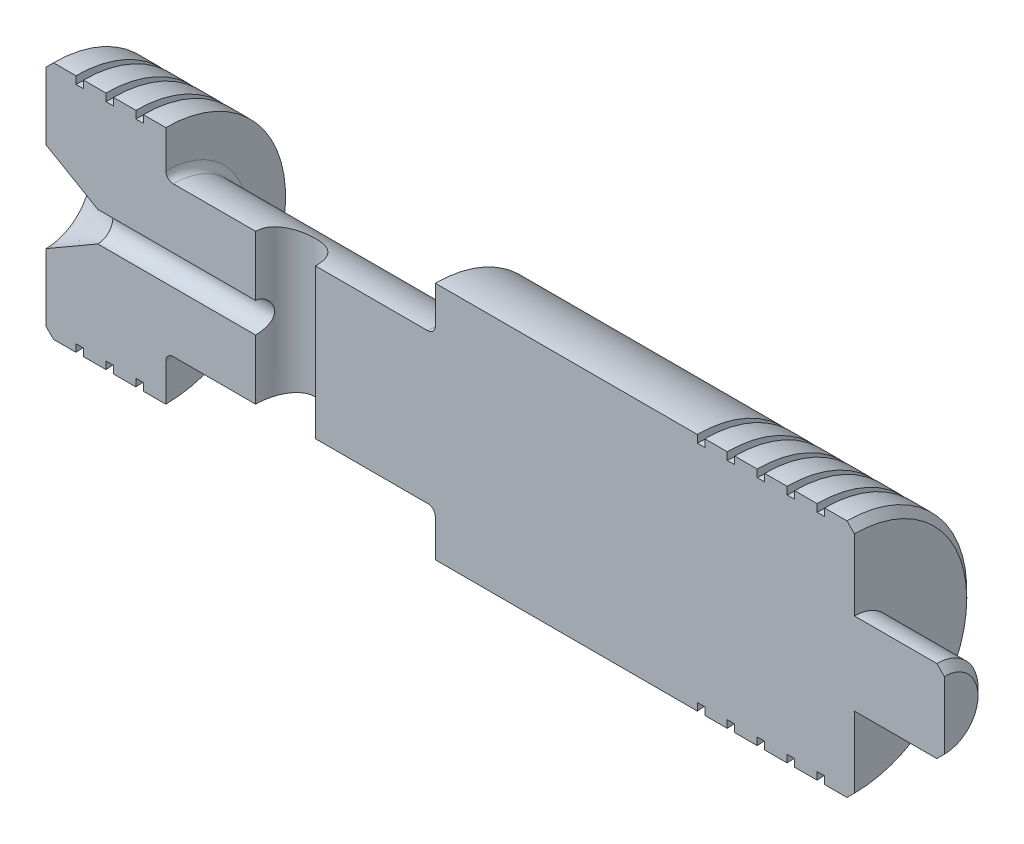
ISO-10303-21;
HEADER;
FILE_DESCRIPTION(('STEP AP214'),'2;1');
FILE_NAME('part.step','',(''),(''),'','','');
FILE_SCHEMA(('AUTOMOTIVE_DESIGN { 1 0 10303 214 1 1 1 1 }'));
ENDSEC;
DATA;
#1=APPLICATION_CONTEXT('core data for automotive mechanical design processes');
#2=APPLICATION_PROTOCOL_DEFINITION('international standard','automotive_design',2000,#1);
#3=PRODUCT_CONTEXT('',#1,'mechanical');
#4=PRODUCT('Part','Part','',(#3));
#5=PRODUCT_RELATED_PRODUCT_CATEGORY('part','',(#4));
#6=PRODUCT_DEFINITION_FORMATION('','',#4);
#7=PRODUCT_DEFINITION_CONTEXT('part definition',#1,'design');
#8=PRODUCT_DEFINITION('design','',#6,#7);
#9=PRODUCT_DEFINITION_SHAPE('','',#8);
#10=(LENGTH_UNIT() NAMED_UNIT(*) SI_UNIT(.MILLI.,.METRE.));
#11=(NAMED_UNIT(*) PLANE_ANGLE_UNIT() SI_UNIT($,.RADIAN.));
#12=(NAMED_UNIT(*) SI_UNIT($,.STERADIAN.) SOLID_ANGLE_UNIT());
#13=UNCERTAINTY_MEASURE_WITH_UNIT(LENGTH_MEASURE(1.E-05),#10,'distance_accuracy_value','');
#14=(GEOMETRIC_REPRESENTATION_CONTEXT(3) GLOBAL_UNCERTAINTY_ASSIGNED_CONTEXT((#13)) GLOBAL_UNIT_ASSIGNED_CONTEXT((#10,
#11,#12)) REPRESENTATION_CONTEXT('',''));
#15=CARTESIAN_POINT('',(0.,0.,0.));
#16=DIRECTION('',(0.,0.,1.));
#17=DIRECTION('',(1.,0.,0.));
#18=AXIS2_PLACEMENT_3D('',#15,#16,#17);
#19=CARTESIAN_POINT('',(0.,0.,0.));
#20=DIRECTION('',(-1.,0.,0.));
#21=DIRECTION('',(0.,0.,1.));
#22=AXIS2_PLACEMENT_3D('',#19,#20,#21);
#23=CONICAL_SURFACE('',#22,3.,0.5235987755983);
#24=CARTESIAN_POINT('',(0.,0.,0.));
#25=DIRECTION('',(-1.,0.,0.));
#26=DIRECTION('',(0.,0.,1.));
#27=AXIS2_PLACEMENT_3D('',#24,#25,#26);
#28=CIRCLE('',#27,3.);
#29=CARTESIAN_POINT('',(0.,3.,0.));
#30=VERTEX_POINT('',#29);
#31=CARTESIAN_POINT('',(0.,-3.,0.));
#32=VERTEX_POINT('',#31);
#33=EDGE_CURVE('E492',#30,#32,#28,.T.);
#34=ORIENTED_EDGE('',*,*,#33,.T.);
#35=DIRECTION('',(-0.866025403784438,-0.500000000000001,0.));
#36=VECTOR('',#35,1.);
#37=CARTESIAN_POINT('',(5.19615242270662,0.,0.));
#38=LINE('',#37,#36);
#39=CARTESIAN_POINT('',(3.46410161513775,-0.999999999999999,0.));
#40=VERTEX_POINT('',#39);
#41=EDGE_CURVE('E622',#32,#40,#38,.F.);
#42=ORIENTED_EDGE('',*,*,#41,.T.);
#43=CARTESIAN_POINT('',(3.46410161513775,0.,0.));
#44=DIRECTION('',(-1.,0.,0.));
#45=DIRECTION('',(0.,0.,1.));
#46=AXIS2_PLACEMENT_3D('',#43,#44,#45);
#47=CIRCLE('',#46,0.999999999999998);
#48=CARTESIAN_POINT('',(3.46410161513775,0.999999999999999,0.));
#49=VERTEX_POINT('',#48);
#50=EDGE_CURVE('E798',#49,#40,#47,.T.);
#51=ORIENTED_EDGE('',*,*,#50,.F.);
#52=DIRECTION('',(0.866025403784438,-0.500000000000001,0.));
#53=VECTOR('',#52,1.);
#54=CARTESIAN_POINT('',(5.19615242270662,0.,0.));
#55=LINE('',#54,#53);
#56=EDGE_CURVE('E630',#49,#30,#55,.F.);
#57=ORIENTED_EDGE('',*,*,#56,.T.);
#58=EDGE_LOOP('',(#34,#42,#51,#57));
#59=FACE_BOUND('',#58,.T.);
#60=ADVANCED_FACE('F27',(#59),#23,.F.);
#61=CARTESIAN_POINT('',(0.,3.,0.));
#62=DIRECTION('',(1.,0.,0.));
#63=DIRECTION('',(0.,0.,-1.));
#64=AXIS2_PLACEMENT_3D('',#61,#62,#63);
#65=PLANE('',#64);
#66=CARTESIAN_POINT('',(0.,0.,0.));
#67=DIRECTION('',(-1.,0.,0.));
#68=DIRECTION('',(0.,0.,1.));
#69=AXIS2_PLACEMENT_3D('',#66,#67,#68);
#70=CIRCLE('',#69,7.5);
#71=CARTESIAN_POINT('',(0.,7.5,0.));
#72=VERTEX_POINT('',#71);
#73=CARTESIAN_POINT('',(0.,-7.5,0.));
#74=VERTEX_POINT('',#73);
#75=EDGE_CURVE('E489',#72,#74,#70,.T.);
#76=ORIENTED_EDGE('',*,*,#75,.T.);
#77=DIRECTION('',(0.,1.,0.));
#78=VECTOR('',#77,1.);
#79=CARTESIAN_POINT('',(0.,3.,0.));
#80=LINE('',#79,#78);
#81=EDGE_CURVE('E611',#74,#32,#80,.T.);
#82=ORIENTED_EDGE('',*,*,#81,.T.);
#83=ORIENTED_EDGE('',*,*,#33,.F.);
#84=EDGE_CURVE('E612',#30,#72,#80,.T.);
#85=ORIENTED_EDGE('',*,*,#84,.T.);
#86=EDGE_LOOP('',(#76,#82,#83,#85));
#87=FACE_BOUND('',#86,.T.);
#88=ADVANCED_FACE('F599',(#87),#65,.F.);
#89=CARTESIAN_POINT('',(0.5,0.,0.));
#90=DIRECTION('',(1.,0.,0.));
#91=DIRECTION('',(0.,0.,-1.));
#92=AXIS2_PLACEMENT_3D('',#89,#90,#91);
#93=CONICAL_SURFACE('',#92,8.,0.785398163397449);
#94=ORIENTED_EDGE('',*,*,#75,.F.);
#95=DIRECTION('',(0.707106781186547,0.707106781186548,0.));
#96=VECTOR('',#95,1.);
#97=CARTESIAN_POINT('',(-7.49999999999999,0.,0.));
#98=LINE('',#97,#96);
#99=CARTESIAN_POINT('',(0.5,8.,0.));
#100=VERTEX_POINT('',#99);
#101=EDGE_CURVE('E615',#72,#100,#98,.T.);
#102=ORIENTED_EDGE('',*,*,#101,.T.);
#103=CARTESIAN_POINT('',(0.5,0.,0.));
#104=DIRECTION('',(-1.,0.,0.));
#105=DIRECTION('',(0.,0.,1.));
#106=AXIS2_PLACEMENT_3D('',#103,#104,#105);
#107=CIRCLE('',#106,8.);
#108=CARTESIAN_POINT('',(0.5,-8.,0.));
#109=VERTEX_POINT('',#108);
#110=EDGE_CURVE('E486',#100,#109,#107,.T.);
#111=ORIENTED_EDGE('',*,*,#110,.T.);
#112=DIRECTION('',(-0.707106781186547,0.707106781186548,0.));
#113=VECTOR('',#112,1.);
#114=CARTESIAN_POINT('',(-7.49999999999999,0.,0.));
#115=LINE('',#114,#113);
#116=EDGE_CURVE('E617',#109,#74,#115,.T.);
#117=ORIENTED_EDGE('',*,*,#116,.T.);
#118=EDGE_LOOP('',(#94,#102,#111,#117));
#119=FACE_BOUND('',#118,.T.);
#120=ADVANCED_FACE('F596',(#119),#93,.T.);
#121=CARTESIAN_POINT('',(0.,0.,0.));
#122=DIRECTION('',(-1.,0.,0.));
#123=DIRECTION('',(0.,0.,1.));
#124=AXIS2_PLACEMENT_3D('',#121,#122,#123);
#125=CYLINDRICAL_SURFACE('',#124,8.);
#126=CARTESIAN_POINT('',(2.,0.,0.));
#127=DIRECTION('',(-1.,0.,0.));
#128=DIRECTION('',(0.,0.,1.));
#129=AXIS2_PLACEMENT_3D('',#126,#127,#128);
#130=CIRCLE('',#129,8.);
#131=CARTESIAN_POINT('',(2.,8.,0.));
#132=VERTEX_POINT('',#131);
#133=CARTESIAN_POINT('',(2.,-8.,0.));
#134=VERTEX_POINT('',#133);
#135=EDGE_CURVE('E483',#132,#134,#130,.T.);
#136=ORIENTED_EDGE('',*,*,#135,.T.);
#137=DIRECTION('',(-1.,0.,0.));
#138=VECTOR('',#137,1.);
#139=CARTESIAN_POINT('',(-3.13953488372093,-8.,0.));
#140=LINE('',#139,#138);
#141=EDGE_CURVE('E362',#134,#109,#140,.T.);
#142=ORIENTED_EDGE('',*,*,#141,.T.);
#143=ORIENTED_EDGE('',*,*,#110,.F.);
#144=DIRECTION('',(-1.,0.,0.));
#145=VECTOR('',#144,1.);
#146=CARTESIAN_POINT('',(-3.13953488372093,8.,0.));
#147=LINE('',#146,#145);
#148=EDGE_CURVE('E365',#132,#100,#147,.T.);
#149=ORIENTED_EDGE('',*,*,#148,.F.);
#150=EDGE_LOOP('',(#136,#142,#143,#149));
#151=FACE_BOUND('',#150,.T.);
#152=ADVANCED_FACE('F592',(#151),#125,.T.);
#153=CARTESIAN_POINT('',(2.,8.,0.));
#154=DIRECTION('',(-1.,0.,0.));
#155=DIRECTION('',(0.,0.,1.));
#156=AXIS2_PLACEMENT_3D('',#153,#154,#155);
#157=PLANE('',#156);
#158=ORIENTED_EDGE('',*,*,#135,.F.);
#159=DIRECTION('',(0.,-1.,0.));
#160=VECTOR('',#159,1.);
#161=CARTESIAN_POINT('',(2.,8.,0.));
#162=LINE('',#161,#160);
#163=CARTESIAN_POINT('',(2.,7.5,0.));
#164=VERTEX_POINT('',#163);
#165=EDGE_CURVE('E756',#132,#164,#162,.T.);
#166=ORIENTED_EDGE('',*,*,#165,.T.);
#167=CARTESIAN_POINT('',(2.,0.,0.));
#168=DIRECTION('',(-1.,0.,0.));
#169=DIRECTION('',(0.,0.,1.));
#170=AXIS2_PLACEMENT_3D('',#167,#168,#169);
#171=CIRCLE('',#170,7.5);
#172=CARTESIAN_POINT('',(2.,-7.5,0.));
#173=VERTEX_POINT('',#172);
#174=EDGE_CURVE('E480',#164,#173,#171,.T.);
#175=ORIENTED_EDGE('',*,*,#174,.T.);
#176=EDGE_CURVE('E503',#173,#134,#162,.T.);
#177=ORIENTED_EDGE('',*,*,#176,.T.);
#178=EDGE_LOOP('',(#158,#166,#175,#177));
#179=FACE_BOUND('',#178,.T.);
#180=ADVANCED_FACE('F588',(#179),#157,.F.);
#181=CARTESIAN_POINT('',(0.,0.,0.));
#182=DIRECTION('',(-1.,0.,0.));
#183=DIRECTION('',(0.,0.,1.));
#184=AXIS2_PLACEMENT_3D('',#181,#182,#183);
#185=CYLINDRICAL_SURFACE('',#184,7.5);
#186=CARTESIAN_POINT('',(2.5,0.,0.));
#187=DIRECTION('',(-1.,0.,0.));
#188=DIRECTION('',(0.,0.,1.));
#189=AXIS2_PLACEMENT_3D('',#186,#187,#188);
#190=CIRCLE('',#189,7.5);
#191=CARTESIAN_POINT('',(2.5,7.5,0.));
#192=VERTEX_POINT('',#191);
#193=CARTESIAN_POINT('',(2.5,-7.5,0.));
#194=VERTEX_POINT('',#193);
#195=EDGE_CURVE('E477',#192,#194,#190,.T.);
#196=ORIENTED_EDGE('',*,*,#195,.T.);
#197=DIRECTION('',(-1.,0.,0.));
#198=VECTOR('',#197,1.);
#199=CARTESIAN_POINT('',(0.,-7.5,0.));
#200=LINE('',#199,#198);
#201=EDGE_CURVE('E523',#194,#173,#200,.T.);
#202=ORIENTED_EDGE('',*,*,#201,.T.);
#203=ORIENTED_EDGE('',*,*,#174,.F.);
#204=DIRECTION('',(-1.,0.,0.));
#205=VECTOR('',#204,1.);
#206=CARTESIAN_POINT('',(0.,7.5,0.));
#207=LINE('',#206,#205);
#208=EDGE_CURVE('E753',#164,#192,#207,.F.);
#209=ORIENTED_EDGE('',*,*,#208,.T.);
#210=EDGE_LOOP('',(#196,#202,#203,#209));
#211=FACE_BOUND('',#210,.T.);
#212=ADVANCED_FACE('F584',(#211),#185,.T.);
#213=CARTESIAN_POINT('',(2.5,7.5,0.));
#214=DIRECTION('',(1.,0.,0.));
#215=DIRECTION('',(0.,0.,-1.));
#216=AXIS2_PLACEMENT_3D('',#213,#214,#215);
#217=PLANE('',#216);
#218=CARTESIAN_POINT('',(2.5,0.,0.));
#219=DIRECTION('',(-1.,0.,0.));
#220=DIRECTION('',(0.,0.,1.));
#221=AXIS2_PLACEMENT_3D('',#218,#219,#220);
#222=CIRCLE('',#221,8.);
#223=CARTESIAN_POINT('',(2.5,8.,0.));
#224=VERTEX_POINT('',#223);
#225=CARTESIAN_POINT('',(2.5,-8.,0.));
#226=VERTEX_POINT('',#225);
#227=EDGE_CURVE('E474',#224,#226,#222,.T.);
#228=ORIENTED_EDGE('',*,*,#227,.T.);
#229=DIRECTION('',(0.,1.,0.));
#230=VECTOR('',#229,1.);
#231=CARTESIAN_POINT('',(2.5,7.5,0.));
#232=LINE('',#231,#230);
#233=EDGE_CURVE('E754',#226,#194,#232,.T.);
#234=ORIENTED_EDGE('',*,*,#233,.T.);
#235=ORIENTED_EDGE('',*,*,#195,.F.);
#236=EDGE_CURVE('E750',#192,#224,#232,.T.);
#237=ORIENTED_EDGE('',*,*,#236,.T.);
#238=EDGE_LOOP('',(#228,#234,#235,#237));
#239=FACE_BOUND('',#238,.T.);
#240=ADVANCED_FACE('F580',(#239),#217,.F.);
#241=CARTESIAN_POINT('',(0.,0.,0.));
#242=DIRECTION('',(-1.,0.,0.));
#243=DIRECTION('',(0.,0.,1.));
#244=AXIS2_PLACEMENT_3D('',#241,#242,#243);
#245=CYLINDRICAL_SURFACE('',#244,8.);
#246=CARTESIAN_POINT('',(4.,0.,0.));
#247=DIRECTION('',(-1.,0.,0.));
#248=DIRECTION('',(0.,0.,1.));
#249=AXIS2_PLACEMENT_3D('',#246,#247,#248);
#250=CIRCLE('',#249,8.);
#251=CARTESIAN_POINT('',(4.,8.,0.));
#252=VERTEX_POINT('',#251);
#253=CARTESIAN_POINT('',(4.,-8.,0.));
#254=VERTEX_POINT('',#253);
#255=EDGE_CURVE('E471',#252,#254,#250,.T.);
#256=ORIENTED_EDGE('',*,*,#255,.T.);
#257=EDGE_CURVE('E769',#254,#226,#140,.T.);
#258=ORIENTED_EDGE('',*,*,#257,.T.);
#259=ORIENTED_EDGE('',*,*,#227,.F.);
#260=EDGE_CURVE('E765',#252,#224,#147,.T.);
#261=ORIENTED_EDGE('',*,*,#260,.F.);
#262=EDGE_LOOP('',(#256,#258,#259,#261));
#263=FACE_BOUND('',#262,.T.);
#264=ADVANCED_FACE('F576',(#263),#245,.T.);
#265=CARTESIAN_POINT('',(4.,8.,0.));
#266=DIRECTION('',(-1.,0.,0.));
#267=DIRECTION('',(0.,0.,1.));
#268=AXIS2_PLACEMENT_3D('',#265,#266,#267);
#269=PLANE('',#268);
#270=ORIENTED_EDGE('',*,*,#255,.F.);
#271=DIRECTION('',(0.,-1.,0.));
#272=VECTOR('',#271,1.);
#273=CARTESIAN_POINT('',(4.,8.,0.));
#274=LINE('',#273,#272);
#275=CARTESIAN_POINT('',(4.,7.5,0.));
#276=VERTEX_POINT('',#275);
#277=EDGE_CURVE('E743',#252,#276,#274,.T.);
#278=ORIENTED_EDGE('',*,*,#277,.T.);
#279=CARTESIAN_POINT('',(4.,0.,0.));
#280=DIRECTION('',(-1.,0.,0.));
#281=DIRECTION('',(0.,0.,1.));
#282=AXIS2_PLACEMENT_3D('',#279,#280,#281);
#283=CIRCLE('',#282,7.5);
#284=CARTESIAN_POINT('',(4.,-7.5,0.));
#285=VERTEX_POINT('',#284);
#286=EDGE_CURVE('E468',#276,#285,#283,.T.);
#287=ORIENTED_EDGE('',*,*,#286,.T.);
#288=EDGE_CURVE('E746',#285,#254,#274,.T.);
#289=ORIENTED_EDGE('',*,*,#288,.T.);
#290=EDGE_LOOP('',(#270,#278,#287,#289));
#291=FACE_BOUND('',#290,.T.);
#292=ADVANCED_FACE('F572',(#291),#269,.F.);
#293=CARTESIAN_POINT('',(0.,0.,0.));
#294=DIRECTION('',(-1.,0.,0.));
#295=DIRECTION('',(0.,0.,1.));
#296=AXIS2_PLACEMENT_3D('',#293,#294,#295);
#297=CYLINDRICAL_SURFACE('',#296,7.5);
#298=CARTESIAN_POINT('',(4.5,0.,0.));
#299=DIRECTION('',(-1.,0.,0.));
#300=DIRECTION('',(0.,0.,1.));
#301=AXIS2_PLACEMENT_3D('',#298,#299,#300);
#302=CIRCLE('',#301,7.5);
#303=CARTESIAN_POINT('',(4.5,7.5,0.));
#304=VERTEX_POINT('',#303);
#305=CARTESIAN_POINT('',(4.5,-7.5,0.));
#306=VERTEX_POINT('',#305);
#307=EDGE_CURVE('E465',#304,#306,#302,.T.);
#308=ORIENTED_EDGE('',*,*,#307,.T.);
#309=DIRECTION('',(-1.,0.,0.));
#310=VECTOR('',#309,1.);
#311=CARTESIAN_POINT('',(0.,-7.5,0.));
#312=LINE('',#311,#310);
#313=EDGE_CURVE('E747',#306,#285,#312,.T.);
#314=ORIENTED_EDGE('',*,*,#313,.T.);
#315=ORIENTED_EDGE('',*,*,#286,.F.);
#316=DIRECTION('',(-1.,0.,0.));
#317=VECTOR('',#316,1.);
#318=CARTESIAN_POINT('',(0.,7.5,0.));
#319=LINE('',#318,#317);
#320=EDGE_CURVE('E739',#276,#304,#319,.F.);
#321=ORIENTED_EDGE('',*,*,#320,.T.);
#322=EDGE_LOOP('',(#308,#314,#315,#321));
#323=FACE_BOUND('',#322,.T.);
#324=ADVANCED_FACE('F568',(#323),#297,.T.);
#325=CARTESIAN_POINT('',(4.5,7.5,0.));
#326=DIRECTION('',(1.,0.,0.));
#327=DIRECTION('',(0.,0.,-1.));
#328=AXIS2_PLACEMENT_3D('',#325,#326,#327);
#329=PLANE('',#328);
#330=CARTESIAN_POINT('',(4.5,0.,0.));
#331=DIRECTION('',(-1.,0.,0.));
#332=DIRECTION('',(0.,0.,1.));
#333=AXIS2_PLACEMENT_3D('',#330,#331,#332);
#334=CIRCLE('',#333,8.);
#335=CARTESIAN_POINT('',(4.5,8.,0.));
#336=VERTEX_POINT('',#335);
#337=CARTESIAN_POINT('',(4.5,-8.,0.));
#338=VERTEX_POINT('',#337);
#339=EDGE_CURVE('E462',#336,#338,#334,.T.);
#340=ORIENTED_EDGE('',*,*,#339,.T.);
#341=DIRECTION('',(0.,1.,0.));
#342=VECTOR('',#341,1.);
#343=CARTESIAN_POINT('',(4.5,7.5,0.));
#344=LINE('',#343,#342);
#345=EDGE_CURVE('E740',#338,#306,#344,.T.);
#346=ORIENTED_EDGE('',*,*,#345,.T.);
#347=ORIENTED_EDGE('',*,*,#307,.F.);
#348=EDGE_CURVE('E736',#304,#336,#344,.T.);
#349=ORIENTED_EDGE('',*,*,#348,.T.);
#350=EDGE_LOOP('',(#340,#346,#347,#349));
#351=FACE_BOUND('',#350,.T.);
#352=ADVANCED_FACE('F564',(#351),#329,.F.);
#353=CARTESIAN_POINT('',(0.,0.,0.));
#354=DIRECTION('',(-1.,0.,0.));
#355=DIRECTION('',(0.,0.,1.));
#356=AXIS2_PLACEMENT_3D('',#353,#354,#355);
#357=CYLINDRICAL_SURFACE('',#356,8.);
#358=CARTESIAN_POINT('',(6.,0.,0.));
#359=DIRECTION('',(-1.,0.,0.));
#360=DIRECTION('',(0.,0.,1.));
#361=AXIS2_PLACEMENT_3D('',#358,#359,#360);
#362=CIRCLE('',#361,8.);
#363=CARTESIAN_POINT('',(6.,8.,0.));
#364=VERTEX_POINT('',#363);
#365=CARTESIAN_POINT('',(6.,-8.,0.));
#366=VERTEX_POINT('',#365);
#367=EDGE_CURVE('E459',#364,#366,#362,.T.);
#368=ORIENTED_EDGE('',*,*,#367,.T.);
#369=EDGE_CURVE('E935',#366,#338,#140,.T.);
#370=ORIENTED_EDGE('',*,*,#369,.T.);
#371=ORIENTED_EDGE('',*,*,#339,.F.);
#372=EDGE_CURVE('E766',#364,#336,#147,.T.);
#373=ORIENTED_EDGE('',*,*,#372,.F.);
#374=EDGE_LOOP('',(#368,#370,#371,#373));
#375=FACE_BOUND('',#374,.T.);
#376=ADVANCED_FACE('F560',(#375),#357,.T.);
#377=CARTESIAN_POINT('',(6.,8.,0.));
#378=DIRECTION('',(-1.,0.,0.));
#379=DIRECTION('',(0.,0.,1.));
#380=AXIS2_PLACEMENT_3D('',#377,#378,#379);
#381=PLANE('',#380);
#382=ORIENTED_EDGE('',*,*,#367,.F.);
#383=DIRECTION('',(0.,-1.,0.));
#384=VECTOR('',#383,1.);
#385=CARTESIAN_POINT('',(6.,8.,0.));
#386=LINE('',#385,#384);
#387=CARTESIAN_POINT('',(6.,7.5,0.));
#388=VERTEX_POINT('',#387);
#389=EDGE_CURVE('E729',#364,#388,#386,.T.);
#390=ORIENTED_EDGE('',*,*,#389,.T.);
#391=CARTESIAN_POINT('',(6.,0.,0.));
#392=DIRECTION('',(-1.,0.,0.));
#393=DIRECTION('',(0.,0.,1.));
#394=AXIS2_PLACEMENT_3D('',#391,#392,#393);
#395=CIRCLE('',#394,7.5);
#396=CARTESIAN_POINT('',(6.,-7.5,0.));
#397=VERTEX_POINT('',#396);
#398=EDGE_CURVE('E456',#388,#397,#395,.T.);
#399=ORIENTED_EDGE('',*,*,#398,.T.);
#400=EDGE_CURVE('E732',#397,#366,#386,.T.);
#401=ORIENTED_EDGE('',*,*,#400,.T.);
#402=EDGE_LOOP('',(#382,#390,#399,#401));
#403=FACE_BOUND('',#402,.T.);
#404=ADVANCED_FACE('F556',(#403),#381,.F.);
#405=CARTESIAN_POINT('',(0.,0.,0.));
#406=DIRECTION('',(-1.,0.,0.));
#407=DIRECTION('',(0.,0.,1.));
#408=AXIS2_PLACEMENT_3D('',#405,#406,#407);
#409=CYLINDRICAL_SURFACE('',#408,7.5);
#410=CARTESIAN_POINT('',(6.5,0.,0.));
#411=DIRECTION('',(-1.,0.,0.));
#412=DIRECTION('',(0.,0.,1.));
#413=AXIS2_PLACEMENT_3D('',#410,#411,#412);
#414=CIRCLE('',#413,7.5);
#415=CARTESIAN_POINT('',(6.5,7.5,0.));
#416=VERTEX_POINT('',#415);
#417=CARTESIAN_POINT('',(6.5,-7.5,0.));
#418=VERTEX_POINT('',#417);
#419=EDGE_CURVE('E453',#416,#418,#414,.T.);
#420=ORIENTED_EDGE('',*,*,#419,.T.);
#421=DIRECTION('',(-1.,0.,0.));
#422=VECTOR('',#421,1.);
#423=CARTESIAN_POINT('',(0.,-7.5,0.));
#424=LINE('',#423,#422);
#425=EDGE_CURVE('E733',#418,#397,#424,.T.);
#426=ORIENTED_EDGE('',*,*,#425,.T.);
#427=ORIENTED_EDGE('',*,*,#398,.F.);
#428=DIRECTION('',(-1.,0.,0.));
#429=VECTOR('',#428,1.);
#430=CARTESIAN_POINT('',(0.,7.5,0.));
#431=LINE('',#430,#429);
#432=EDGE_CURVE('E725',#388,#416,#431,.F.);
#433=ORIENTED_EDGE('',*,*,#432,.T.);
#434=EDGE_LOOP('',(#420,#426,#427,#433));
#435=FACE_BOUND('',#434,.T.);
#436=ADVANCED_FACE('F552',(#435),#409,.T.);
#437=CARTESIAN_POINT('',(6.5,7.5,0.));
#438=DIRECTION('',(1.,0.,0.));
#439=DIRECTION('',(0.,0.,-1.));
#440=AXIS2_PLACEMENT_3D('',#437,#438,#439);
#441=PLANE('',#440);
#442=CARTESIAN_POINT('',(6.5,0.,0.));
#443=DIRECTION('',(-1.,0.,0.));
#444=DIRECTION('',(0.,0.,1.));
#445=AXIS2_PLACEMENT_3D('',#442,#443,#444);
#446=CIRCLE('',#445,8.);
#447=CARTESIAN_POINT('',(6.5,8.,0.));
#448=VERTEX_POINT('',#447);
#449=CARTESIAN_POINT('',(6.5,-8.,0.));
#450=VERTEX_POINT('',#449);
#451=EDGE_CURVE('E450',#448,#450,#446,.T.);
#452=ORIENTED_EDGE('',*,*,#451,.T.);
#453=DIRECTION('',(0.,1.,0.));
#454=VECTOR('',#453,1.);
#455=CARTESIAN_POINT('',(6.5,7.5,0.));
#456=LINE('',#455,#454);
#457=EDGE_CURVE('E726',#450,#418,#456,.T.);
#458=ORIENTED_EDGE('',*,*,#457,.T.);
#459=ORIENTED_EDGE('',*,*,#419,.F.);
#460=EDGE_CURVE('E722',#416,#448,#456,.T.);
#461=ORIENTED_EDGE('',*,*,#460,.T.);
#462=EDGE_LOOP('',(#452,#458,#459,#461));
#463=FACE_BOUND('',#462,.T.);
#464=ADVANCED_FACE('F548',(#463),#441,.F.);
#465=CARTESIAN_POINT('',(0.,0.,0.));
#466=DIRECTION('',(-1.,0.,0.));
#467=DIRECTION('',(0.,0.,1.));
#468=AXIS2_PLACEMENT_3D('',#465,#466,#467);
#469=CYLINDRICAL_SURFACE('',#468,8.);
#470=CARTESIAN_POINT('',(8.,0.,0.));
#471=DIRECTION('',(-1.,0.,0.));
#472=DIRECTION('',(0.,0.,1.));
#473=AXIS2_PLACEMENT_3D('',#470,#471,#472);
#474=CIRCLE('',#473,8.);
#475=CARTESIAN_POINT('',(8.,8.,0.));
#476=VERTEX_POINT('',#475);
#477=CARTESIAN_POINT('',(8.,-8.,0.));
#478=VERTEX_POINT('',#477);
#479=EDGE_CURVE('E447',#476,#478,#474,.T.);
#480=ORIENTED_EDGE('',*,*,#479,.T.);
#481=EDGE_CURVE('E931',#478,#450,#140,.T.);
#482=ORIENTED_EDGE('',*,*,#481,.T.);
#483=ORIENTED_EDGE('',*,*,#451,.F.);
#484=EDGE_CURVE('E952',#476,#448,#147,.T.);
#485=ORIENTED_EDGE('',*,*,#484,.F.);
#486=EDGE_LOOP('',(#480,#482,#483,#485));
#487=FACE_BOUND('',#486,.T.);
#488=ADVANCED_FACE('F544',(#487),#469,.T.);
#489=CARTESIAN_POINT('',(8.,8.,0.));
#490=DIRECTION('',(-1.,0.,0.));
#491=DIRECTION('',(0.,0.,1.));
#492=AXIS2_PLACEMENT_3D('',#489,#490,#491);
#493=PLANE('',#492);
#494=ORIENTED_EDGE('',*,*,#479,.F.);
#495=DIRECTION('',(0.,-1.,0.));
#496=VECTOR('',#495,1.);
#497=CARTESIAN_POINT('',(8.,8.,0.));
#498=LINE('',#497,#496);
#499=CARTESIAN_POINT('',(8.,5.5,0.));
#500=VERTEX_POINT('',#499);
#501=EDGE_CURVE('E629',#476,#500,#498,.T.);
#502=ORIENTED_EDGE('',*,*,#501,.T.);
#503=CARTESIAN_POINT('',(8.,0.,0.));
#504=DIRECTION('',(-1.,0.,0.));
#505=DIRECTION('',(0.,0.,1.));
#506=AXIS2_PLACEMENT_3D('',#503,#504,#505);
#507=CIRCLE('',#506,5.5);
#508=CARTESIAN_POINT('',(8.,-5.5,0.));
#509=VERTEX_POINT('',#508);
#510=EDGE_CURVE('E444',#500,#509,#507,.T.);
#511=ORIENTED_EDGE('',*,*,#510,.T.);
#512=EDGE_CURVE('E793',#509,#478,#498,.T.);
#513=ORIENTED_EDGE('',*,*,#512,.T.);
#514=EDGE_LOOP('',(#494,#502,#511,#513));
#515=FACE_BOUND('',#514,.T.);
#516=ADVANCED_FACE('F540',(#515),#493,.F.);
#517=CARTESIAN_POINT('',(8.5,0.,0.));
#518=DIRECTION('',(-1.,0.,0.));
#519=DIRECTION('',(0.,0.,1.));
#520=AXIS2_PLACEMENT_3D('',#517,#518,#519);
#521=TOROIDAL_SURFACE('',#520,5.5,0.5);
#522=CARTESIAN_POINT('',(8.5,0.,0.));
#523=DIRECTION('',(-1.,0.,0.));
#524=DIRECTION('',(0.,0.,1.));
#525=AXIS2_PLACEMENT_3D('',#522,#523,#524);
#526=CIRCLE('',#525,5.);
#527=CARTESIAN_POINT('',(8.5,5.,0.));
#528=VERTEX_POINT('',#527);
#529=CARTESIAN_POINT('',(8.5,-5.,0.));
#530=VERTEX_POINT('',#529);
#531=EDGE_CURVE('E441',#528,#530,#526,.T.);
#532=ORIENTED_EDGE('',*,*,#531,.T.);
#533=CARTESIAN_POINT('',(8.5,-5.5,0.));
#534=DIRECTION('',(0.,0.,-1.));
#535=DIRECTION('',(-1.,0.,0.));
#536=AXIS2_PLACEMENT_3D('',#533,#534,#535);
#537=CIRCLE('',#536,0.5);
#538=EDGE_CURVE('E790',#530,#509,#537,.F.);
#539=ORIENTED_EDGE('',*,*,#538,.T.);
#540=ORIENTED_EDGE('',*,*,#510,.F.);
#541=CARTESIAN_POINT('',(8.5,5.5,0.));
#542=DIRECTION('',(0.,0.,-1.));
#543=DIRECTION('',(-1.,0.,0.));
#544=AXIS2_PLACEMENT_3D('',#541,#542,#543);
#545=CIRCLE('',#544,0.5);
#546=EDGE_CURVE('E626',#500,#528,#545,.F.);
#547=ORIENTED_EDGE('',*,*,#546,.T.);
#548=EDGE_LOOP('',(#532,#539,#540,#547));
#549=FACE_BOUND('',#548,.T.);
#550=ADVANCED_FACE('F534',(#549),#521,.F.);
#551=CARTESIAN_POINT('',(0.,0.,0.));
#552=DIRECTION('',(-1.,0.,0.));
#553=DIRECTION('',(0.,0.,1.));
#554=AXIS2_PLACEMENT_3D('',#551,#552,#553);
#555=CYLINDRICAL_SURFACE('',#554,5.);
#556=CARTESIAN_POINT('',(25.5,0.,0.));
#557=DIRECTION('',(-1.,0.,0.));
#558=DIRECTION('',(0.,0.,1.));
#559=AXIS2_PLACEMENT_3D('',#556,#557,#558);
#560=CIRCLE('',#559,5.);
#561=CARTESIAN_POINT('',(25.5,5.,0.));
#562=VERTEX_POINT('',#561);
#563=CARTESIAN_POINT('',(25.5,-5.,0.));
#564=VERTEX_POINT('',#563);
#565=EDGE_CURVE('E438',#562,#564,#560,.T.);
#566=ORIENTED_EDGE('',*,*,#565,.T.);
#567=DIRECTION('',(-1.,0.,0.));
#568=VECTOR('',#567,1.);
#569=CARTESIAN_POINT('',(0.,-5.,0.));
#570=LINE('',#569,#568);
#571=CARTESIAN_POINT('',(18.,-5.,0.));
#572=VERTEX_POINT('',#571);
#573=EDGE_CURVE('E774',#564,#572,#570,.T.);
#574=ORIENTED_EDGE('',*,*,#573,.T.);
#575=CARTESIAN_POINT('',(16.,-4.58257569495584,2.));
#576=CARTESIAN_POINT('',(16.107123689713,-4.58258022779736,1.99999540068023));
#577=CARTESIAN_POINT('',(16.2144262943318,-4.58638433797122,1.99134173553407));
#578=CARTESIAN_POINT('',(16.4259390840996,-4.601110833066,1.95706710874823));
#579=CARTESIAN_POINT('',(16.5301406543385,-4.61205140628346,1.93140279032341));
#580=CARTESIAN_POINT('',(16.7320518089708,-4.63960410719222,1.86423554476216));
#581=CARTESIAN_POINT('',(16.8297842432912,-4.65619484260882,1.82279228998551));
#582=CARTESIAN_POINT('',(17.0168853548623,-4.69314677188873,1.72542013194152));
#583=CARTESIAN_POINT('',(17.1062558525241,-4.71350714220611,1.66949439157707));
#584=CARTESIAN_POINT('',(17.2792603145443,-4.75700861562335,1.54132201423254));
#585=CARTESIAN_POINT('',(17.3623563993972,-4.78023917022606,1.46837936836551));
#586=CARTESIAN_POINT('',(17.5155290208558,-4.82612457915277,1.30970909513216));
#587=CARTESIAN_POINT('',(17.5856010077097,-4.84877922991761,1.22397701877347));
#588=CARTESIAN_POINT('',(17.7134063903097,-4.89203407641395,1.03800631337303));
#589=CARTESIAN_POINT('',(17.7705442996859,-4.9125180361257,0.937328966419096));
#590=CARTESIAN_POINT('',(17.8668435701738,-4.94803927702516,0.72682532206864));
#591=CARTESIAN_POINT('',(17.9060122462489,-4.96307877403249,0.617002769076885));
#592=CARTESIAN_POINT('',(17.9633414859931,-4.98538324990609,0.396966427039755));
#593=CARTESIAN_POINT('',(17.9824273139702,-4.99298936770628,0.287028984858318));
#594=CARTESIAN_POINT('',(18.0020284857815,-5.0008031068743,0.0652663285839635));
#595=CARTESIAN_POINT('',(18.0025507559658,-5.00101348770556,-0.0465581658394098));
#596=CARTESIAN_POINT('',(17.9855172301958,-4.99421962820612,-0.262232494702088));
#597=CARTESIAN_POINT('',(17.9689752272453,-4.98761996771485,-0.366177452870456));
#598=CARTESIAN_POINT('',(17.920007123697,-4.96849291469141,-0.569673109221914));
#599=CARTESIAN_POINT('',(17.8875798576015,-4.95596508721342,-0.669223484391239));
#600=CARTESIAN_POINT('',(17.8073635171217,-4.92596824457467,-0.862897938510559));
#601=CARTESIAN_POINT('',(17.7593502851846,-4.90842760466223,-0.956917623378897));
#602=CARTESIAN_POINT('',(17.6495349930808,-4.87014585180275,-1.13580815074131));
#603=CARTESIAN_POINT('',(17.5877282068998,-4.84940364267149,-1.22067584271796));
#604=CARTESIAN_POINT('',(17.4473508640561,-4.80521637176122,-1.38476882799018));
#605=CARTESIAN_POINT('',(17.3679461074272,-4.78168326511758,-1.46325784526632));
#606=CARTESIAN_POINT('',(17.197009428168,-4.73561660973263,-1.60610741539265));
#607=CARTESIAN_POINT('',(17.1054735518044,-4.71308339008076,-1.67046334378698));
#608=CARTESIAN_POINT('',(16.9095809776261,-4.67096897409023,-1.78490418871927));
#609=CARTESIAN_POINT('',(16.8049351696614,-4.65148914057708,-1.83453465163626));
#610=CARTESIAN_POINT('',(16.5877845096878,-4.61887590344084,-1.91517625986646));
#611=CARTESIAN_POINT('',(16.4752848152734,-4.60573837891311,-1.94619949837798));
#612=CARTESIAN_POINT('',(16.2529642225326,-4.58829759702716,-1.9869549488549));
#613=CARTESIAN_POINT('',(16.1433995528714,-4.58350366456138,-1.99787209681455));
#614=CARTESIAN_POINT('',(15.9239227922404,-4.58189497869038,-2.00156132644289));
#615=CARTESIAN_POINT('',(15.8140108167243,-4.58507780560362,-1.99433891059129));
#616=CARTESIAN_POINT('',(15.6035410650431,-4.59856044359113,-1.96303289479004));
#617=CARTESIAN_POINT('',(15.5028070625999,-4.60844457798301,-1.93993306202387));
#618=CARTESIAN_POINT('',(15.3067115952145,-4.6337005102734,-1.87880418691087));
#619=CARTESIAN_POINT('',(15.2113513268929,-4.64907352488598,-1.84077183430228));
#620=CARTESIAN_POINT('',(15.0243976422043,-4.68433781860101,-1.74913563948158));
#621=CARTESIAN_POINT('',(14.9331138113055,-4.70438704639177,-1.69496286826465));
#622=CARTESIAN_POINT('',(14.7605170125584,-4.74650385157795,-1.57316522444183));
#623=CARTESIAN_POINT('',(14.6792081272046,-4.76857224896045,-1.5055348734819));
#624=CARTESIAN_POINT('',(14.5226265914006,-4.81420915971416,-1.35284421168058));
#625=CARTESIAN_POINT('',(14.4482434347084,-4.83776807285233,-1.26686542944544));
#626=CARTESIAN_POINT('',(14.3148229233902,-4.88219794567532,-1.08308363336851));
#627=CARTESIAN_POINT('',(14.2557861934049,-4.90306879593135,-0.985280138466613));
#628=CARTESIAN_POINT('',(14.1549523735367,-4.9398371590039,-0.780279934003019));
#629=CARTESIAN_POINT('',(14.1131511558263,-4.9557358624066,-0.673085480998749));
#630=CARTESIAN_POINT('',(14.0484511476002,-4.98072713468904,-0.452393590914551));
#631=CARTESIAN_POINT('',(14.0255420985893,-4.98982339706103,-0.338899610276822));
#632=CARTESIAN_POINT('',(14.0004952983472,-4.99979008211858,-0.116816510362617));
#633=CARTESIAN_POINT('',(13.997099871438,-5.00115846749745,-0.008390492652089));
#634=CARTESIAN_POINT('',(14.0078554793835,-4.99686042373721,0.207433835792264));
#635=CARTESIAN_POINT('',(14.0220038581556,-4.99119505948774,0.314832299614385));
#636=CARTESIAN_POINT('',(14.0665467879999,-4.97371513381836,0.522170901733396));
#637=CARTESIAN_POINT('',(14.0964289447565,-4.96209480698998,0.622238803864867));
#638=CARTESIAN_POINT('',(14.1710528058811,-4.93394947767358,0.815922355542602));
#639=CARTESIAN_POINT('',(14.2157972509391,-4.91742357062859,0.909536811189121));
#640=CARTESIAN_POINT('',(14.3211031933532,-4.88018094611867,1.09220303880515));
#641=CARTESIAN_POINT('',(14.3822762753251,-4.859311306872,1.18087037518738));
#642=CARTESIAN_POINT('',(14.517788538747,-4.8158940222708,1.34705404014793));
#643=CARTESIAN_POINT('',(14.5921331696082,-4.79334568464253,1.42456572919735));
#644=CARTESIAN_POINT('',(14.7573151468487,-4.7473776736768,1.57120121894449));
#645=CARTESIAN_POINT('',(14.8488885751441,-4.72399047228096,1.63950871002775));
#646=CARTESIAN_POINT('',(15.0429424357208,-4.68049656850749,1.7598476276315));
#647=CARTESIAN_POINT('',(15.1454241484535,-4.66039025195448,1.81187714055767));
#648=CARTESIAN_POINT('',(15.3490361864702,-4.62758914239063,1.89399048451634));
#649=CARTESIAN_POINT('',(15.4494616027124,-4.61439096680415,1.92562535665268));
#650=CARTESIAN_POINT('',(15.6544890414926,-4.5944582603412,1.9727199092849));
#651=CARTESIAN_POINT('',(15.7590785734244,-4.58770572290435,1.98822466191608));
#652=CARTESIAN_POINT('',(15.8867782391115,-4.5839176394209,1.99692202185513));
#653=CARTESIAN_POINT('',(15.9094014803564,-4.58341531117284,1.99807530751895));
#654=CARTESIAN_POINT('',(15.9546804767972,-4.58274384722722,1.99961481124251));
#655=CARTESIAN_POINT('',(15.9773362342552,-4.5825747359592,2.0000009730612));
#656=CARTESIAN_POINT('',(16.,-4.58257569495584,2.));
#657=B_SPLINE_CURVE_WITH_KNOTS('',3,(#575,#576,#577,#578,#579,#580,#581,#582,#583,#584,#585,
#586,#587,#588,#589,#590,#591,#592,#593,#594,#595,#596,#597,#598,#599,#600,#601,#602,#603,#604,
#605,#606,#607,#608,#609,#610,#611,#612,#613,#614,#615,#616,#617,#618,#619,#620,#621,#622,#623,
#624,#625,#626,#627,#628,#629,#630,#631,#632,#633,#634,#635,#636,#637,#638,#639,#640,#641,#642,
#643,#644,#645,#646,#647,#648,#649,#650,#651,#652,#653,#654,#655,#656),.UNSPECIFIED.,.T.,.F.,(4,
2,2,2,2,2,2,2,2,2,2,2,2,2,2,2,2,2,2,2,2,2,2,2,2,2,2,2,2,2,2,2,2,2,2,2,2,2,2,2,4),(0.,
0.321277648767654,0.643377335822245,0.964270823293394,1.28509428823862,1.62255618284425,
1.96013574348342,2.31102669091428,2.66177466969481,2.99554182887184,3.32918445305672,
3.64408644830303,3.9590115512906,4.27868300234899,4.59846414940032,4.93924044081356,
5.28012807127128,5.63064458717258,5.98093304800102,6.30982147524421,6.6386101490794,
6.94867248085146,7.25880358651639,7.58151154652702,7.9043511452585,8.2510373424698,
8.59773764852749,8.94435487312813,9.29078375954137,9.61461039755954,9.93838801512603,
10.2522199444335,10.5661097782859,10.8938705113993,11.2217671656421,11.5699625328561,
11.9181988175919,12.2351666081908,12.5512463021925,12.619212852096,12.6871843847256),.UNSPECIFIED.);
#658=CARTESIAN_POINT('',(14.,-5.,0.));
#659=VERTEX_POINT('',#658);
#660=EDGE_CURVE('E522',#572,#659,#657,.T.);
#661=ORIENTED_EDGE('',*,*,#660,.T.);
#662=EDGE_CURVE('E41',#659,#530,#570,.T.);
#663=ORIENTED_EDGE('',*,*,#662,.T.);
#664=ORIENTED_EDGE('',*,*,#531,.F.);
#665=DIRECTION('',(-1.,0.,0.));
#666=VECTOR('',#665,1.);
#667=CARTESIAN_POINT('',(0.,5.,0.));
#668=LINE('',#667,#666);
#669=CARTESIAN_POINT('',(14.,5.,0.));
#670=VERTEX_POINT('',#669);
#671=EDGE_CURVE('E620',#528,#670,#668,.F.);
#672=ORIENTED_EDGE('',*,*,#671,.T.);
#673=CARTESIAN_POINT('',(16.,4.58257569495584,2.));
#674=CARTESIAN_POINT('',(15.892876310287,4.58258022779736,1.99999540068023));
#675=CARTESIAN_POINT('',(15.7855737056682,4.58638433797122,1.99134173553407));
#676=CARTESIAN_POINT('',(15.5740609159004,4.601110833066,1.95706710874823));
#677=CARTESIAN_POINT('',(15.4698593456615,4.61205140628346,1.93140279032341));
#678=CARTESIAN_POINT('',(15.2679481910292,4.63960410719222,1.86423554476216));
#679=CARTESIAN_POINT('',(15.1702157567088,4.65619484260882,1.82279228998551));
#680=CARTESIAN_POINT('',(14.9831146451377,4.69314677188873,1.72542013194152));
#681=CARTESIAN_POINT('',(14.8937441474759,4.71350714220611,1.66949439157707));
#682=CARTESIAN_POINT('',(14.7207396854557,4.75700861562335,1.54132201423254));
#683=CARTESIAN_POINT('',(14.6376436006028,4.78023917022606,1.46837936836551));
#684=CARTESIAN_POINT('',(14.4844709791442,4.82612457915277,1.30970909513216));
#685=CARTESIAN_POINT('',(14.4143989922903,4.84877922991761,1.22397701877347));
#686=CARTESIAN_POINT('',(14.2865936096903,4.89203407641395,1.03800631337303));
#687=CARTESIAN_POINT('',(14.2294557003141,4.9125180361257,0.937328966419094));
#688=CARTESIAN_POINT('',(14.1331564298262,4.94803927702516,0.726825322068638));
#689=CARTESIAN_POINT('',(14.0939877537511,4.96307877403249,0.617002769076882));
#690=CARTESIAN_POINT('',(14.0366585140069,4.98538324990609,0.396966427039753));
#691=CARTESIAN_POINT('',(14.0175726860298,4.99298936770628,0.287028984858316));
#692=CARTESIAN_POINT('',(13.9979715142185,5.0008031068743,0.065266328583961));
#693=CARTESIAN_POINT('',(13.9974492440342,5.00101348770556,-0.0465581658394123));
#694=CARTESIAN_POINT('',(14.0144827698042,4.99421962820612,-0.26223249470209));
#695=CARTESIAN_POINT('',(14.0310247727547,4.98761996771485,-0.366177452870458));
#696=CARTESIAN_POINT('',(14.079992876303,4.96849291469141,-0.569673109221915));
#697=CARTESIAN_POINT('',(14.1124201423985,4.95596508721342,-0.66922348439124));
#698=CARTESIAN_POINT('',(14.1926364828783,4.92596824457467,-0.86289793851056));
#699=CARTESIAN_POINT('',(14.2406497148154,4.90842760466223,-0.956917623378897));
#700=CARTESIAN_POINT('',(14.3504650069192,4.87014585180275,-1.13580815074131));
#701=CARTESIAN_POINT('',(14.4122717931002,4.84940364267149,-1.22067584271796));
#702=CARTESIAN_POINT('',(14.5526491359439,4.80521637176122,-1.38476882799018));
#703=CARTESIAN_POINT('',(14.6320538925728,4.78168326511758,-1.46325784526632));
#704=CARTESIAN_POINT('',(14.802990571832,4.73561660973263,-1.60610741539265));
#705=CARTESIAN_POINT('',(14.8945264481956,4.71308339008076,-1.67046334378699));
#706=CARTESIAN_POINT('',(15.0904190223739,4.67096897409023,-1.78490418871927));
#707=CARTESIAN_POINT('',(15.1950648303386,4.65148914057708,-1.83453465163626));
#708=CARTESIAN_POINT('',(15.4122154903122,4.61887590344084,-1.91517625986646));
#709=CARTESIAN_POINT('',(15.5247151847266,4.60573837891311,-1.94619949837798));
#710=CARTESIAN_POINT('',(15.7470357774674,4.58829759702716,-1.9869549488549));
#711=CARTESIAN_POINT('',(15.8566004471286,4.58350366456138,-1.99787209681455));
#712=CARTESIAN_POINT('',(16.0760772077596,4.58189497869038,-2.00156132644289));
#713=CARTESIAN_POINT('',(16.1859891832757,4.58507780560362,-1.99433891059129));
#714=CARTESIAN_POINT('',(16.3964589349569,4.59856044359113,-1.96303289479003));
#715=CARTESIAN_POINT('',(16.4971929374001,4.60844457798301,-1.93993306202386));
#716=CARTESIAN_POINT('',(16.6932884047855,4.6337005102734,-1.87880418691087));
#717=CARTESIAN_POINT('',(16.7886486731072,4.64907352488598,-1.84077183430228));
#718=CARTESIAN_POINT('',(16.9756023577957,4.68433781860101,-1.74913563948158));
#719=CARTESIAN_POINT('',(17.0668861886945,4.70438704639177,-1.69496286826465));
#720=CARTESIAN_POINT('',(17.2394829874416,4.74650385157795,-1.57316522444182));
#721=CARTESIAN_POINT('',(17.3207918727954,4.76857224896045,-1.5055348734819));
#722=CARTESIAN_POINT('',(17.4773734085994,4.81420915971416,-1.35284421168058));
#723=CARTESIAN_POINT('',(17.5517565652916,4.83776807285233,-1.26686542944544));
#724=CARTESIAN_POINT('',(17.6851770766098,4.88219794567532,-1.08308363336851));
#725=CARTESIAN_POINT('',(17.7442138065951,4.90306879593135,-0.98528013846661));
#726=CARTESIAN_POINT('',(17.8450476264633,4.9398371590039,-0.780279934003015));
#727=CARTESIAN_POINT('',(17.8868488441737,4.9557358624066,-0.673085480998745));
#728=CARTESIAN_POINT('',(17.9515488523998,4.98072713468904,-0.452393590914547));
#729=CARTESIAN_POINT('',(17.9744579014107,4.98982339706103,-0.338899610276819));
#730=CARTESIAN_POINT('',(17.9995047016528,4.99979008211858,-0.116816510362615));
#731=CARTESIAN_POINT('',(18.002900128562,5.00115846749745,-0.00839049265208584));
#732=CARTESIAN_POINT('',(17.9921445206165,4.99686042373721,0.207433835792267));
#733=CARTESIAN_POINT('',(17.9779961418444,4.99119505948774,0.314832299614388));
#734=CARTESIAN_POINT('',(17.9334532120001,4.97371513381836,0.522170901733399));
#735=CARTESIAN_POINT('',(17.9035710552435,4.96209480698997,0.62223880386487));
#736=CARTESIAN_POINT('',(17.8289471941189,4.93394947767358,0.815922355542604));
#737=CARTESIAN_POINT('',(17.7842027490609,4.91742357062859,0.909536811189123));
#738=CARTESIAN_POINT('',(17.6788968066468,4.88018094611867,1.09220303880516));
#739=CARTESIAN_POINT('',(17.6177237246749,4.859311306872,1.18087037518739));
#740=CARTESIAN_POINT('',(17.482211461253,4.8158940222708,1.34705404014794));
#741=CARTESIAN_POINT('',(17.4078668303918,4.79334568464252,1.42456572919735));
#742=CARTESIAN_POINT('',(17.2426848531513,4.7473776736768,1.5712012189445));
#743=CARTESIAN_POINT('',(17.1511114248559,4.72399047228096,1.63950871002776));
#744=CARTESIAN_POINT('',(16.9570575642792,4.68049656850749,1.7598476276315));
#745=CARTESIAN_POINT('',(16.8545758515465,4.66039025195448,1.81187714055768));
#746=CARTESIAN_POINT('',(16.6509638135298,4.62758914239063,1.89399048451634));
#747=CARTESIAN_POINT('',(16.5505383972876,4.61439096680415,1.92562535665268));
#748=CARTESIAN_POINT('',(16.3455109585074,4.59445826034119,1.9727199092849));
#749=CARTESIAN_POINT('',(16.2409214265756,4.58770572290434,1.98822466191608));
#750=CARTESIAN_POINT('',(16.1132217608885,4.5839176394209,1.99692202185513));
#751=CARTESIAN_POINT('',(16.0905985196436,4.58341531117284,1.99807530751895));
#752=CARTESIAN_POINT('',(16.0453195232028,4.58274384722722,1.99961481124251));
#753=CARTESIAN_POINT('',(16.0226637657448,4.5825747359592,2.0000009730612));
#754=CARTESIAN_POINT('',(16.,4.58257569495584,2.));
#755=B_SPLINE_CURVE_WITH_KNOTS('',3,(#673,#674,#675,#676,#677,#678,#679,#680,#681,#682,#683,
#684,#685,#686,#687,#688,#689,#690,#691,#692,#693,#694,#695,#696,#697,#698,#699,#700,#701,#702,
#703,#704,#705,#706,#707,#708,#709,#710,#711,#712,#713,#714,#715,#716,#717,#718,#719,#720,#721,
#722,#723,#724,#725,#726,#727,#728,#729,#730,#731,#732,#733,#734,#735,#736,#737,#738,#739,#740,
#741,#742,#743,#744,#745,#746,#747,#748,#749,#750,#751,#752,#753,#754),.UNSPECIFIED.,.T.,.F.,(4,
2,2,2,2,2,2,2,2,2,2,2,2,2,2,2,2,2,2,2,2,2,2,2,2,2,2,2,2,2,2,2,2,2,2,2,2,2,2,2,4),(0.,
0.321277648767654,0.643377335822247,0.964270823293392,1.28509428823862,1.62255618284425,
1.96013574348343,2.31102669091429,2.66177466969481,2.99554182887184,3.32918445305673,
3.64408644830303,3.9590115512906,4.27868300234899,4.59846414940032,4.93924044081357,
5.28012807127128,5.63064458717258,5.98093304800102,6.30982147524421,6.63861014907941,
6.94867248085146,7.25880358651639,7.58151154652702,7.90435114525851,8.25103734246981,
8.59773764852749,8.94435487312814,9.29078375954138,9.61461039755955,9.93838801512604,
10.2522199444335,10.5661097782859,10.8938705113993,11.2217671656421,11.5699625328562,
11.9181988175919,12.2351666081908,12.5512463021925,12.619212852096,12.6871843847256),.UNSPECIFIED.);
#756=CARTESIAN_POINT('',(18.,5.,0.));
#757=VERTEX_POINT('',#756);
#758=EDGE_CURVE('E502',#670,#757,#755,.T.);
#759=ORIENTED_EDGE('',*,*,#758,.T.);
#760=EDGE_CURVE('E771',#757,#562,#668,.F.);
#761=ORIENTED_EDGE('',*,*,#760,.T.);
#762=EDGE_LOOP('',(#566,#574,#661,#663,#664,#672,#759,#761));
#763=FACE_BOUND('',#762,.T.);
#764=ADVANCED_FACE('F528',(#763),#555,.T.);
#765=CARTESIAN_POINT('',(25.5,0.,0.));
#766=DIRECTION('',(-1.,0.,0.));
#767=DIRECTION('',(0.,0.,1.));
#768=AXIS2_PLACEMENT_3D('',#765,#766,#767);
#769=TOROIDAL_SURFACE('',#768,5.5,0.5);
#770=CARTESIAN_POINT('',(26.,0.,0.));
#771=DIRECTION('',(-1.,0.,0.));
#772=DIRECTION('',(0.,0.,1.));
#773=AXIS2_PLACEMENT_3D('',#770,#771,#772);
#774=CIRCLE('',#773,5.5);
#775=CARTESIAN_POINT('',(26.,5.5,0.));
#776=VERTEX_POINT('',#775);
#777=CARTESIAN_POINT('',(26.,-5.5,0.));
#778=VERTEX_POINT('',#777);
#779=EDGE_CURVE('E435',#776,#778,#774,.T.);
#780=ORIENTED_EDGE('',*,*,#779,.T.);
#781=CARTESIAN_POINT('',(25.5,-5.5,0.));
#782=DIRECTION('',(0.,0.,-1.));
#783=DIRECTION('',(-1.,0.,0.));
#784=AXIS2_PLACEMENT_3D('',#781,#782,#783);
#785=CIRCLE('',#784,0.5);
#786=EDGE_CURVE('E780',#778,#564,#785,.F.);
#787=ORIENTED_EDGE('',*,*,#786,.T.);
#788=ORIENTED_EDGE('',*,*,#565,.F.);
#789=CARTESIAN_POINT('',(25.5,5.5,0.));
#790=DIRECTION('',(0.,0.,-1.));
#791=DIRECTION('',(-1.,0.,0.));
#792=AXIS2_PLACEMENT_3D('',#789,#790,#791);
#793=CIRCLE('',#792,0.5);
#794=EDGE_CURVE('E777',#562,#776,#793,.F.);
#795=ORIENTED_EDGE('',*,*,#794,.T.);
#796=EDGE_LOOP('',(#780,#787,#788,#795));
#797=FACE_BOUND('',#796,.T.);
#798=ADVANCED_FACE('F533',(#797),#769,.F.);
#799=CARTESIAN_POINT('',(26.,5.5,0.));
#800=DIRECTION('',(1.,0.,0.));
#801=DIRECTION('',(0.,0.,-1.));
#802=AXIS2_PLACEMENT_3D('',#799,#800,#801);
#803=PLANE('',#802);
#804=CARTESIAN_POINT('',(26.,0.,0.));
#805=DIRECTION('',(-1.,0.,0.));
#806=DIRECTION('',(0.,0.,1.));
#807=AXIS2_PLACEMENT_3D('',#804,#805,#806);
#808=CIRCLE('',#807,8.);
#809=CARTESIAN_POINT('',(26.,8.,0.));
#810=VERTEX_POINT('',#809);
#811=CARTESIAN_POINT('',(26.,-8.,0.));
#812=VERTEX_POINT('',#811);
#813=EDGE_CURVE('E432',#810,#812,#808,.T.);
#814=ORIENTED_EDGE('',*,*,#813,.T.);
#815=DIRECTION('',(0.,1.,0.));
#816=VECTOR('',#815,1.);
#817=CARTESIAN_POINT('',(26.,5.5,0.));
#818=LINE('',#817,#816);
#819=EDGE_CURVE('E786',#812,#778,#818,.T.);
#820=ORIENTED_EDGE('',*,*,#819,.T.);
#821=ORIENTED_EDGE('',*,*,#779,.F.);
#822=EDGE_CURVE('E783',#776,#810,#818,.T.);
#823=ORIENTED_EDGE('',*,*,#822,.T.);
#824=EDGE_LOOP('',(#814,#820,#821,#823));
#825=FACE_BOUND('',#824,.T.);
#826=ADVANCED_FACE('F913',(#825),#803,.F.);
#827=CARTESIAN_POINT('',(0.,0.,0.));
#828=DIRECTION('',(-1.,0.,0.));
#829=DIRECTION('',(0.,0.,1.));
#830=AXIS2_PLACEMENT_3D('',#827,#828,#829);
#831=CYLINDRICAL_SURFACE('',#830,8.);
#832=CARTESIAN_POINT('',(43.5,0.,0.));
#833=DIRECTION('',(-1.,0.,0.));
#834=DIRECTION('',(0.,0.,1.));
#835=AXIS2_PLACEMENT_3D('',#832,#833,#834);
#836=CIRCLE('',#835,8.);
#837=CARTESIAN_POINT('',(43.5,8.,0.));
#838=VERTEX_POINT('',#837);
#839=CARTESIAN_POINT('',(43.5,-8.,0.));
#840=VERTEX_POINT('',#839);
#841=EDGE_CURVE('E429',#838,#840,#836,.T.);
#842=ORIENTED_EDGE('',*,*,#841,.T.);
#843=EDGE_CURVE('E928',#840,#812,#140,.T.);
#844=ORIENTED_EDGE('',*,*,#843,.T.);
#845=ORIENTED_EDGE('',*,*,#813,.F.);
#846=EDGE_CURVE('E926',#838,#810,#147,.T.);
#847=ORIENTED_EDGE('',*,*,#846,.F.);
#848=EDGE_LOOP('',(#842,#844,#845,#847));
#849=FACE_BOUND('',#848,.T.);
#850=ADVANCED_FACE('F910',(#849),#831,.T.);
#851=CARTESIAN_POINT('',(43.5,7.5,0.));
#852=DIRECTION('',(-1.,0.,0.));
#853=DIRECTION('',(0.,0.,1.));
#854=AXIS2_PLACEMENT_3D('',#851,#852,#853);
#855=PLANE('',#854);
#856=ORIENTED_EDGE('',*,*,#841,.F.);
#857=DIRECTION('',(0.,-1.,0.));
#858=VECTOR('',#857,1.);
#859=CARTESIAN_POINT('',(43.5,7.5,0.));
#860=LINE('',#859,#858);
#861=CARTESIAN_POINT('',(43.5,7.5,0.));
#862=VERTEX_POINT('',#861);
#863=EDGE_CURVE('E715',#838,#862,#860,.T.);
#864=ORIENTED_EDGE('',*,*,#863,.T.);
#865=CARTESIAN_POINT('',(43.5,0.,0.));
#866=DIRECTION('',(-1.,0.,0.));
#867=DIRECTION('',(0.,0.,1.));
#868=AXIS2_PLACEMENT_3D('',#865,#866,#867);
#869=CIRCLE('',#868,7.5);
#870=CARTESIAN_POINT('',(43.5,-7.5,0.));
#871=VERTEX_POINT('',#870);
#872=EDGE_CURVE('E426',#862,#871,#869,.T.);
#873=ORIENTED_EDGE('',*,*,#872,.T.);
#874=EDGE_CURVE('E718',#871,#840,#860,.T.);
#875=ORIENTED_EDGE('',*,*,#874,.T.);
#876=EDGE_LOOP('',(#856,#864,#873,#875));
#877=FACE_BOUND('',#876,.T.);
#878=ADVANCED_FACE('F906',(#877),#855,.F.);
#879=CARTESIAN_POINT('',(0.,0.,0.));
#880=DIRECTION('',(-1.,0.,0.));
#881=DIRECTION('',(0.,0.,1.));
#882=AXIS2_PLACEMENT_3D('',#879,#880,#881);
#883=CYLINDRICAL_SURFACE('',#882,7.5);
#884=CARTESIAN_POINT('',(44.,0.,0.));
#885=DIRECTION('',(-1.,0.,0.));
#886=DIRECTION('',(0.,0.,1.));
#887=AXIS2_PLACEMENT_3D('',#884,#885,#886);
#888=CIRCLE('',#887,7.5);
#889=CARTESIAN_POINT('',(44.,7.5,0.));
#890=VERTEX_POINT('',#889);
#891=CARTESIAN_POINT('',(44.,-7.5,0.));
#892=VERTEX_POINT('',#891);
#893=EDGE_CURVE('E423',#890,#892,#888,.T.);
#894=ORIENTED_EDGE('',*,*,#893,.T.);
#895=DIRECTION('',(-1.,0.,0.));
#896=VECTOR('',#895,1.);
#897=CARTESIAN_POINT('',(0.,-7.5,0.));
#898=LINE('',#897,#896);
#899=EDGE_CURVE('E719',#892,#871,#898,.T.);
#900=ORIENTED_EDGE('',*,*,#899,.T.);
#901=ORIENTED_EDGE('',*,*,#872,.F.);
#902=DIRECTION('',(-1.,0.,0.));
#903=VECTOR('',#902,1.);
#904=CARTESIAN_POINT('',(0.,7.5,0.));
#905=LINE('',#904,#903);
#906=EDGE_CURVE('E711',#862,#890,#905,.F.);
#907=ORIENTED_EDGE('',*,*,#906,.T.);
#908=EDGE_LOOP('',(#894,#900,#901,#907));
#909=FACE_BOUND('',#908,.T.);
#910=ADVANCED_FACE('F902',(#909),#883,.T.);
#911=CARTESIAN_POINT('',(44.,8.,0.));
#912=DIRECTION('',(1.,0.,0.));
#913=DIRECTION('',(0.,0.,-1.));
#914=AXIS2_PLACEMENT_3D('',#911,#912,#913);
#915=PLANE('',#914);
#916=CARTESIAN_POINT('',(44.,0.,0.));
#917=DIRECTION('',(-1.,0.,0.));
#918=DIRECTION('',(0.,0.,1.));
#919=AXIS2_PLACEMENT_3D('',#916,#917,#918);
#920=CIRCLE('',#919,8.);
#921=CARTESIAN_POINT('',(44.,8.,0.));
#922=VERTEX_POINT('',#921);
#923=CARTESIAN_POINT('',(44.,-8.,0.));
#924=VERTEX_POINT('',#923);
#925=EDGE_CURVE('E420',#922,#924,#920,.T.);
#926=ORIENTED_EDGE('',*,*,#925,.T.);
#927=DIRECTION('',(0.,1.,0.));
#928=VECTOR('',#927,1.);
#929=CARTESIAN_POINT('',(44.,8.,0.));
#930=LINE('',#929,#928);
#931=EDGE_CURVE('E712',#924,#892,#930,.T.);
#932=ORIENTED_EDGE('',*,*,#931,.T.);
#933=ORIENTED_EDGE('',*,*,#893,.F.);
#934=EDGE_CURVE('E708',#890,#922,#930,.T.);
#935=ORIENTED_EDGE('',*,*,#934,.T.);
#936=EDGE_LOOP('',(#926,#932,#933,#935));
#937=FACE_BOUND('',#936,.T.);
#938=ADVANCED_FACE('F898',(#937),#915,.F.);
#939=CARTESIAN_POINT('',(0.,0.,0.));
#940=DIRECTION('',(-1.,0.,0.));
#941=DIRECTION('',(0.,0.,1.));
#942=AXIS2_PLACEMENT_3D('',#939,#940,#941);
#943=CYLINDRICAL_SURFACE('',#942,8.);
#944=CARTESIAN_POINT('',(45.5,0.,0.));
#945=DIRECTION('',(-1.,0.,0.));
#946=DIRECTION('',(0.,0.,1.));
#947=AXIS2_PLACEMENT_3D('',#944,#945,#946);
#948=CIRCLE('',#947,8.);
#949=CARTESIAN_POINT('',(45.5,8.,0.));
#950=VERTEX_POINT('',#949);
#951=CARTESIAN_POINT('',(45.5,-8.,0.));
#952=VERTEX_POINT('',#951);
#953=EDGE_CURVE('E417',#950,#952,#948,.T.);
#954=ORIENTED_EDGE('',*,*,#953,.T.);
#955=EDGE_CURVE('E930',#952,#924,#140,.T.);
#956=ORIENTED_EDGE('',*,*,#955,.T.);
#957=ORIENTED_EDGE('',*,*,#925,.F.);
#958=EDGE_CURVE('E954',#950,#922,#147,.T.);
#959=ORIENTED_EDGE('',*,*,#958,.F.);
#960=EDGE_LOOP('',(#954,#956,#957,#959));
#961=FACE_BOUND('',#960,.T.);
#962=ADVANCED_FACE('F894',(#961),#943,.T.);
#963=CARTESIAN_POINT('',(45.5,7.5,0.));
#964=DIRECTION('',(-1.,0.,0.));
#965=DIRECTION('',(0.,0.,1.));
#966=AXIS2_PLACEMENT_3D('',#963,#964,#965);
#967=PLANE('',#966);
#968=ORIENTED_EDGE('',*,*,#953,.F.);
#969=DIRECTION('',(0.,-1.,0.));
#970=VECTOR('',#969,1.);
#971=CARTESIAN_POINT('',(45.5,7.5,0.));
#972=LINE('',#971,#970);
#973=CARTESIAN_POINT('',(45.5,7.5,0.));
#974=VERTEX_POINT('',#973);
#975=EDGE_CURVE('E701',#950,#974,#972,.T.);
#976=ORIENTED_EDGE('',*,*,#975,.T.);
#977=CARTESIAN_POINT('',(45.5,0.,0.));
#978=DIRECTION('',(-1.,0.,0.));
#979=DIRECTION('',(0.,0.,1.));
#980=AXIS2_PLACEMENT_3D('',#977,#978,#979);
#981=CIRCLE('',#980,7.5);
#982=CARTESIAN_POINT('',(45.5,-7.5,0.));
#983=VERTEX_POINT('',#982);
#984=EDGE_CURVE('E414',#974,#983,#981,.T.);
#985=ORIENTED_EDGE('',*,*,#984,.T.);
#986=EDGE_CURVE('E704',#983,#952,#972,.T.);
#987=ORIENTED_EDGE('',*,*,#986,.T.);
#988=EDGE_LOOP('',(#968,#976,#985,#987));
#989=FACE_BOUND('',#988,.T.);
#990=ADVANCED_FACE('F890',(#989),#967,.F.);
#991=CARTESIAN_POINT('',(0.,0.,0.));
#992=DIRECTION('',(-1.,0.,0.));
#993=DIRECTION('',(0.,0.,1.));
#994=AXIS2_PLACEMENT_3D('',#991,#992,#993);
#995=CYLINDRICAL_SURFACE('',#994,7.5);
#996=CARTESIAN_POINT('',(46.,0.,0.));
#997=DIRECTION('',(-1.,0.,0.));
#998=DIRECTION('',(0.,0.,1.));
#999=AXIS2_PLACEMENT_3D('',#996,#997,#998);
#1000=CIRCLE('',#999,7.5);
#1001=CARTESIAN_POINT('',(46.,7.5,0.));
#1002=VERTEX_POINT('',#1001);
#1003=CARTESIAN_POINT('',(46.,-7.5,0.));
#1004=VERTEX_POINT('',#1003);
#1005=EDGE_CURVE('E411',#1002,#1004,#1000,.T.);
#1006=ORIENTED_EDGE('',*,*,#1005,.T.);
#1007=DIRECTION('',(-1.,0.,0.));
#1008=VECTOR('',#1007,1.);
#1009=CARTESIAN_POINT('',(0.,-7.5,0.));
#1010=LINE('',#1009,#1008);
#1011=EDGE_CURVE('E705',#1004,#983,#1010,.T.);
#1012=ORIENTED_EDGE('',*,*,#1011,.T.);
#1013=ORIENTED_EDGE('',*,*,#984,.F.);
#1014=DIRECTION('',(-1.,0.,0.));
#1015=VECTOR('',#1014,1.);
#1016=CARTESIAN_POINT('',(0.,7.5,0.));
#1017=LINE('',#1016,#1015);
#1018=EDGE_CURVE('E697',#974,#1002,#1017,.F.);
#1019=ORIENTED_EDGE('',*,*,#1018,.T.);
#1020=EDGE_LOOP('',(#1006,#1012,#1013,#1019));
#1021=FACE_BOUND('',#1020,.T.);
#1022=ADVANCED_FACE('F886',(#1021),#995,.T.);
#1023=CARTESIAN_POINT('',(46.,8.,0.));
#1024=DIRECTION('',(1.,0.,0.));
#1025=DIRECTION('',(0.,0.,-1.));
#1026=AXIS2_PLACEMENT_3D('',#1023,#1024,#1025);
#1027=PLANE('',#1026);
#1028=CARTESIAN_POINT('',(46.,0.,0.));
#1029=DIRECTION('',(-1.,0.,0.));
#1030=DIRECTION('',(0.,0.,1.));
#1031=AXIS2_PLACEMENT_3D('',#1028,#1029,#1030);
#1032=CIRCLE('',#1031,8.);
#1033=CARTESIAN_POINT('',(46.,8.,0.));
#1034=VERTEX_POINT('',#1033);
#1035=CARTESIAN_POINT('',(46.,-8.,0.));
#1036=VERTEX_POINT('',#1035);
#1037=EDGE_CURVE('E408',#1034,#1036,#1032,.T.);
#1038=ORIENTED_EDGE('',*,*,#1037,.T.);
#1039=DIRECTION('',(0.,1.,0.));
#1040=VECTOR('',#1039,1.);
#1041=CARTESIAN_POINT('',(46.,8.,0.));
#1042=LINE('',#1041,#1040);
#1043=EDGE_CURVE('E698',#1036,#1004,#1042,.T.);
#1044=ORIENTED_EDGE('',*,*,#1043,.T.);
#1045=ORIENTED_EDGE('',*,*,#1005,.F.);
#1046=EDGE_CURVE('E694',#1002,#1034,#1042,.T.);
#1047=ORIENTED_EDGE('',*,*,#1046,.T.);
#1048=EDGE_LOOP('',(#1038,#1044,#1045,#1047));
#1049=FACE_BOUND('',#1048,.T.);
#1050=ADVANCED_FACE('F882',(#1049),#1027,.F.);
#1051=CARTESIAN_POINT('',(0.,0.,0.));
#1052=DIRECTION('',(-1.,0.,0.));
#1053=DIRECTION('',(0.,0.,1.));
#1054=AXIS2_PLACEMENT_3D('',#1051,#1052,#1053);
#1055=CYLINDRICAL_SURFACE('',#1054,8.);
#1056=CARTESIAN_POINT('',(47.5,0.,0.));
#1057=DIRECTION('',(-1.,0.,0.));
#1058=DIRECTION('',(0.,0.,1.));
#1059=AXIS2_PLACEMENT_3D('',#1056,#1057,#1058);
#1060=CIRCLE('',#1059,8.);
#1061=CARTESIAN_POINT('',(47.5,8.,0.));
#1062=VERTEX_POINT('',#1061);
#1063=CARTESIAN_POINT('',(47.5,-8.,0.));
#1064=VERTEX_POINT('',#1063);
#1065=EDGE_CURVE('E405',#1062,#1064,#1060,.T.);
#1066=ORIENTED_EDGE('',*,*,#1065,.T.);
#1067=EDGE_CURVE('E933',#1064,#1036,#140,.T.);
#1068=ORIENTED_EDGE('',*,*,#1067,.T.);
#1069=ORIENTED_EDGE('',*,*,#1037,.F.);
#1070=EDGE_CURVE('E955',#1062,#1034,#147,.T.);
#1071=ORIENTED_EDGE('',*,*,#1070,.F.);
#1072=EDGE_LOOP('',(#1066,#1068,#1069,#1071));
#1073=FACE_BOUND('',#1072,.T.);
#1074=ADVANCED_FACE('F878',(#1073),#1055,.T.);
#1075=CARTESIAN_POINT('',(47.5,7.5,0.));
#1076=DIRECTION('',(-1.,0.,0.));
#1077=DIRECTION('',(0.,0.,1.));
#1078=AXIS2_PLACEMENT_3D('',#1075,#1076,#1077);
#1079=PLANE('',#1078);
#1080=ORIENTED_EDGE('',*,*,#1065,.F.);
#1081=DIRECTION('',(0.,-1.,0.));
#1082=VECTOR('',#1081,1.);
#1083=CARTESIAN_POINT('',(47.5,7.5,0.));
#1084=LINE('',#1083,#1082);
#1085=CARTESIAN_POINT('',(47.5,7.5,0.));
#1086=VERTEX_POINT('',#1085);
#1087=EDGE_CURVE('E687',#1062,#1086,#1084,.T.);
#1088=ORIENTED_EDGE('',*,*,#1087,.T.);
#1089=CARTESIAN_POINT('',(47.5,0.,0.));
#1090=DIRECTION('',(-1.,0.,0.));
#1091=DIRECTION('',(0.,0.,1.));
#1092=AXIS2_PLACEMENT_3D('',#1089,#1090,#1091);
#1093=CIRCLE('',#1092,7.5);
#1094=CARTESIAN_POINT('',(47.5,-7.5,0.));
#1095=VERTEX_POINT('',#1094);
#1096=EDGE_CURVE('E402',#1086,#1095,#1093,.T.);
#1097=ORIENTED_EDGE('',*,*,#1096,.T.);
#1098=EDGE_CURVE('E690',#1095,#1064,#1084,.T.);
#1099=ORIENTED_EDGE('',*,*,#1098,.T.);
#1100=EDGE_LOOP('',(#1080,#1088,#1097,#1099));
#1101=FACE_BOUND('',#1100,.T.);
#1102=ADVANCED_FACE('F874',(#1101),#1079,.F.);
#1103=CARTESIAN_POINT('',(0.,0.,0.));
#1104=DIRECTION('',(-1.,0.,0.));
#1105=DIRECTION('',(0.,0.,1.));
#1106=AXIS2_PLACEMENT_3D('',#1103,#1104,#1105);
#1107=CYLINDRICAL_SURFACE('',#1106,7.5);
#1108=CARTESIAN_POINT('',(48.,0.,0.));
#1109=DIRECTION('',(-1.,0.,0.));
#1110=DIRECTION('',(0.,0.,1.));
#1111=AXIS2_PLACEMENT_3D('',#1108,#1109,#1110);
#1112=CIRCLE('',#1111,7.5);
#1113=CARTESIAN_POINT('',(48.,7.5,0.));
#1114=VERTEX_POINT('',#1113);
#1115=CARTESIAN_POINT('',(48.,-7.5,0.));
#1116=VERTEX_POINT('',#1115);
#1117=EDGE_CURVE('E399',#1114,#1116,#1112,.T.);
#1118=ORIENTED_EDGE('',*,*,#1117,.T.);
#1119=DIRECTION('',(-1.,0.,0.));
#1120=VECTOR('',#1119,1.);
#1121=CARTESIAN_POINT('',(0.,-7.5,0.));
#1122=LINE('',#1121,#1120);
#1123=EDGE_CURVE('E691',#1116,#1095,#1122,.T.);
#1124=ORIENTED_EDGE('',*,*,#1123,.T.);
#1125=ORIENTED_EDGE('',*,*,#1096,.F.);
#1126=DIRECTION('',(-1.,0.,0.));
#1127=VECTOR('',#1126,1.);
#1128=CARTESIAN_POINT('',(0.,7.5,0.));
#1129=LINE('',#1128,#1127);
#1130=EDGE_CURVE('E683',#1086,#1114,#1129,.F.);
#1131=ORIENTED_EDGE('',*,*,#1130,.T.);
#1132=EDGE_LOOP('',(#1118,#1124,#1125,#1131));
#1133=FACE_BOUND('',#1132,.T.);
#1134=ADVANCED_FACE('F870',(#1133),#1107,.T.);
#1135=CARTESIAN_POINT('',(48.,8.,0.));
#1136=DIRECTION('',(1.,0.,0.));
#1137=DIRECTION('',(0.,0.,-1.));
#1138=AXIS2_PLACEMENT_3D('',#1135,#1136,#1137);
#1139=PLANE('',#1138);
#1140=CARTESIAN_POINT('',(48.,0.,0.));
#1141=DIRECTION('',(-1.,0.,0.));
#1142=DIRECTION('',(0.,0.,1.));
#1143=AXIS2_PLACEMENT_3D('',#1140,#1141,#1142);
#1144=CIRCLE('',#1143,8.);
#1145=CARTESIAN_POINT('',(48.,8.,0.));
#1146=VERTEX_POINT('',#1145);
#1147=CARTESIAN_POINT('',(48.,-8.,0.));
#1148=VERTEX_POINT('',#1147);
#1149=EDGE_CURVE('E396',#1146,#1148,#1144,.T.);
#1150=ORIENTED_EDGE('',*,*,#1149,.T.);
#1151=DIRECTION('',(0.,1.,0.));
#1152=VECTOR('',#1151,1.);
#1153=CARTESIAN_POINT('',(48.,8.,0.));
#1154=LINE('',#1153,#1152);
#1155=EDGE_CURVE('E684',#1148,#1116,#1154,.T.);
#1156=ORIENTED_EDGE('',*,*,#1155,.T.);
#1157=ORIENTED_EDGE('',*,*,#1117,.F.);
#1158=EDGE_CURVE('E680',#1114,#1146,#1154,.T.);
#1159=ORIENTED_EDGE('',*,*,#1158,.T.);
#1160=EDGE_LOOP('',(#1150,#1156,#1157,#1159));
#1161=FACE_BOUND('',#1160,.T.);
#1162=ADVANCED_FACE('F866',(#1161),#1139,.F.);
#1163=CARTESIAN_POINT('',(0.,0.,0.));
#1164=DIRECTION('',(-1.,0.,0.));
#1165=DIRECTION('',(0.,0.,1.));
#1166=AXIS2_PLACEMENT_3D('',#1163,#1164,#1165);
#1167=CYLINDRICAL_SURFACE('',#1166,8.);
#1168=CARTESIAN_POINT('',(49.5,0.,0.));
#1169=DIRECTION('',(-1.,0.,0.));
#1170=DIRECTION('',(0.,0.,1.));
#1171=AXIS2_PLACEMENT_3D('',#1168,#1169,#1170);
#1172=CIRCLE('',#1171,8.);
#1173=CARTESIAN_POINT('',(49.5,8.,0.));
#1174=VERTEX_POINT('',#1173);
#1175=CARTESIAN_POINT('',(49.5,-8.,0.));
#1176=VERTEX_POINT('',#1175);
#1177=EDGE_CURVE('E393',#1174,#1176,#1172,.T.);
#1178=ORIENTED_EDGE('',*,*,#1177,.T.);
#1179=EDGE_CURVE('E968',#1176,#1148,#140,.T.);
#1180=ORIENTED_EDGE('',*,*,#1179,.T.);
#1181=ORIENTED_EDGE('',*,*,#1149,.F.);
#1182=EDGE_CURVE('E957',#1174,#1146,#147,.T.);
#1183=ORIENTED_EDGE('',*,*,#1182,.F.);
#1184=EDGE_LOOP('',(#1178,#1180,#1181,#1183));
#1185=FACE_BOUND('',#1184,.T.);
#1186=ADVANCED_FACE('F862',(#1185),#1167,.T.);
#1187=CARTESIAN_POINT('',(49.5,7.5,0.));
#1188=DIRECTION('',(-1.,0.,0.));
#1189=DIRECTION('',(0.,0.,1.));
#1190=AXIS2_PLACEMENT_3D('',#1187,#1188,#1189);
#1191=PLANE('',#1190);
#1192=ORIENTED_EDGE('',*,*,#1177,.F.);
#1193=DIRECTION('',(0.,-1.,0.));
#1194=VECTOR('',#1193,1.);
#1195=CARTESIAN_POINT('',(49.5,7.5,0.));
#1196=LINE('',#1195,#1194);
#1197=CARTESIAN_POINT('',(49.5,7.5,0.));
#1198=VERTEX_POINT('',#1197);
#1199=EDGE_CURVE('E673',#1174,#1198,#1196,.T.);
#1200=ORIENTED_EDGE('',*,*,#1199,.T.);
#1201=CARTESIAN_POINT('',(49.5,0.,0.));
#1202=DIRECTION('',(-1.,0.,0.));
#1203=DIRECTION('',(0.,0.,1.));
#1204=AXIS2_PLACEMENT_3D('',#1201,#1202,#1203);
#1205=CIRCLE('',#1204,7.5);
#1206=CARTESIAN_POINT('',(49.5,-7.5,0.));
#1207=VERTEX_POINT('',#1206);
#1208=EDGE_CURVE('E390',#1198,#1207,#1205,.T.);
#1209=ORIENTED_EDGE('',*,*,#1208,.T.);
#1210=EDGE_CURVE('E676',#1207,#1176,#1196,.T.);
#1211=ORIENTED_EDGE('',*,*,#1210,.T.);
#1212=EDGE_LOOP('',(#1192,#1200,#1209,#1211));
#1213=FACE_BOUND('',#1212,.T.);
#1214=ADVANCED_FACE('F858',(#1213),#1191,.F.);
#1215=CARTESIAN_POINT('',(0.,0.,0.));
#1216=DIRECTION('',(-1.,0.,0.));
#1217=DIRECTION('',(0.,0.,1.));
#1218=AXIS2_PLACEMENT_3D('',#1215,#1216,#1217);
#1219=CYLINDRICAL_SURFACE('',#1218,7.5);
#1220=CARTESIAN_POINT('',(50.,0.,0.));
#1221=DIRECTION('',(-1.,0.,0.));
#1222=DIRECTION('',(0.,0.,1.));
#1223=AXIS2_PLACEMENT_3D('',#1220,#1221,#1222);
#1224=CIRCLE('',#1223,7.5);
#1225=CARTESIAN_POINT('',(50.,7.5,0.));
#1226=VERTEX_POINT('',#1225);
#1227=CARTESIAN_POINT('',(50.,-7.5,0.));
#1228=VERTEX_POINT('',#1227);
#1229=EDGE_CURVE('E387',#1226,#1228,#1224,.T.);
#1230=ORIENTED_EDGE('',*,*,#1229,.T.);
#1231=DIRECTION('',(-1.,0.,0.));
#1232=VECTOR('',#1231,1.);
#1233=CARTESIAN_POINT('',(0.,-7.5,0.));
#1234=LINE('',#1233,#1232);
#1235=EDGE_CURVE('E677',#1228,#1207,#1234,.T.);
#1236=ORIENTED_EDGE('',*,*,#1235,.T.);
#1237=ORIENTED_EDGE('',*,*,#1208,.F.);
#1238=DIRECTION('',(-1.,0.,0.));
#1239=VECTOR('',#1238,1.);
#1240=CARTESIAN_POINT('',(0.,7.5,0.));
#1241=LINE('',#1240,#1239);
#1242=EDGE_CURVE('E669',#1198,#1226,#1241,.F.);
#1243=ORIENTED_EDGE('',*,*,#1242,.T.);
#1244=EDGE_LOOP('',(#1230,#1236,#1237,#1243));
#1245=FACE_BOUND('',#1244,.T.);
#1246=ADVANCED_FACE('F854',(#1245),#1219,.T.);
#1247=CARTESIAN_POINT('',(50.,8.,0.));
#1248=DIRECTION('',(1.,0.,0.));
#1249=DIRECTION('',(0.,0.,-1.));
#1250=AXIS2_PLACEMENT_3D('',#1247,#1248,#1249);
#1251=PLANE('',#1250);
#1252=CARTESIAN_POINT('',(50.,0.,0.));
#1253=DIRECTION('',(-1.,0.,0.));
#1254=DIRECTION('',(0.,0.,1.));
#1255=AXIS2_PLACEMENT_3D('',#1252,#1253,#1254);
#1256=CIRCLE('',#1255,8.);
#1257=CARTESIAN_POINT('',(50.,8.,0.));
#1258=VERTEX_POINT('',#1257);
#1259=CARTESIAN_POINT('',(50.,-8.,0.));
#1260=VERTEX_POINT('',#1259);
#1261=EDGE_CURVE('E384',#1258,#1260,#1256,.T.);
#1262=ORIENTED_EDGE('',*,*,#1261,.T.);
#1263=DIRECTION('',(0.,1.,0.));
#1264=VECTOR('',#1263,1.);
#1265=CARTESIAN_POINT('',(50.,8.,0.));
#1266=LINE('',#1265,#1264);
#1267=EDGE_CURVE('E670',#1260,#1228,#1266,.T.);
#1268=ORIENTED_EDGE('',*,*,#1267,.T.);
#1269=ORIENTED_EDGE('',*,*,#1229,.F.);
#1270=EDGE_CURVE('E666',#1226,#1258,#1266,.T.);
#1271=ORIENTED_EDGE('',*,*,#1270,.T.);
#1272=EDGE_LOOP('',(#1262,#1268,#1269,#1271));
#1273=FACE_BOUND('',#1272,.T.);
#1274=ADVANCED_FACE('F850',(#1273),#1251,.F.);
#1275=CARTESIAN_POINT('',(0.,0.,0.));
#1276=DIRECTION('',(-1.,0.,0.));
#1277=DIRECTION('',(0.,0.,1.));
#1278=AXIS2_PLACEMENT_3D('',#1275,#1276,#1277);
#1279=CYLINDRICAL_SURFACE('',#1278,8.);
#1280=CARTESIAN_POINT('',(51.5,0.,0.));
#1281=DIRECTION('',(-1.,0.,0.));
#1282=DIRECTION('',(0.,0.,1.));
#1283=AXIS2_PLACEMENT_3D('',#1280,#1281,#1282);
#1284=CIRCLE('',#1283,8.);
#1285=CARTESIAN_POINT('',(51.5,8.,0.));
#1286=VERTEX_POINT('',#1285);
#1287=CARTESIAN_POINT('',(51.5,-8.,0.));
#1288=VERTEX_POINT('',#1287);
#1289=EDGE_CURVE('E381',#1286,#1288,#1284,.T.);
#1290=ORIENTED_EDGE('',*,*,#1289,.T.);
#1291=EDGE_CURVE('E966',#1288,#1260,#140,.T.);
#1292=ORIENTED_EDGE('',*,*,#1291,.T.);
#1293=ORIENTED_EDGE('',*,*,#1261,.F.);
#1294=EDGE_CURVE('E363',#1286,#1258,#147,.T.);
#1295=ORIENTED_EDGE('',*,*,#1294,.F.);
#1296=EDGE_LOOP('',(#1290,#1292,#1293,#1295));
#1297=FACE_BOUND('',#1296,.T.);
#1298=ADVANCED_FACE('F846',(#1297),#1279,.T.);
#1299=CARTESIAN_POINT('',(51.5,7.5,0.));
#1300=DIRECTION('',(-1.,0.,0.));
#1301=DIRECTION('',(0.,0.,1.));
#1302=AXIS2_PLACEMENT_3D('',#1299,#1300,#1301);
#1303=PLANE('',#1302);
#1304=ORIENTED_EDGE('',*,*,#1289,.F.);
#1305=DIRECTION('',(0.,-1.,0.));
#1306=VECTOR('',#1305,1.);
#1307=CARTESIAN_POINT('',(51.5,7.5,0.));
#1308=LINE('',#1307,#1306);
#1309=CARTESIAN_POINT('',(51.5,7.5,0.));
#1310=VERTEX_POINT('',#1309);
#1311=EDGE_CURVE('E659',#1286,#1310,#1308,.T.);
#1312=ORIENTED_EDGE('',*,*,#1311,.T.);
#1313=CARTESIAN_POINT('',(51.5,0.,0.));
#1314=DIRECTION('',(-1.,0.,0.));
#1315=DIRECTION('',(0.,0.,1.));
#1316=AXIS2_PLACEMENT_3D('',#1313,#1314,#1315);
#1317=CIRCLE('',#1316,7.5);
#1318=CARTESIAN_POINT('',(51.5,-7.5,0.));
#1319=VERTEX_POINT('',#1318);
#1320=EDGE_CURVE('E378',#1310,#1319,#1317,.T.);
#1321=ORIENTED_EDGE('',*,*,#1320,.T.);
#1322=EDGE_CURVE('E662',#1319,#1288,#1308,.T.);
#1323=ORIENTED_EDGE('',*,*,#1322,.T.);
#1324=EDGE_LOOP('',(#1304,#1312,#1321,#1323));
#1325=FACE_BOUND('',#1324,.T.);
#1326=ADVANCED_FACE('F842',(#1325),#1303,.F.);
#1327=CARTESIAN_POINT('',(0.,0.,0.));
#1328=DIRECTION('',(-1.,0.,0.));
#1329=DIRECTION('',(0.,0.,1.));
#1330=AXIS2_PLACEMENT_3D('',#1327,#1328,#1329);
#1331=CYLINDRICAL_SURFACE('',#1330,7.5);
#1332=CARTESIAN_POINT('',(52.,0.,0.));
#1333=DIRECTION('',(-1.,0.,0.));
#1334=DIRECTION('',(0.,0.,1.));
#1335=AXIS2_PLACEMENT_3D('',#1332,#1333,#1334);
#1336=CIRCLE('',#1335,7.5);
#1337=CARTESIAN_POINT('',(52.,7.5,0.));
#1338=VERTEX_POINT('',#1337);
#1339=CARTESIAN_POINT('',(52.,-7.5,0.));
#1340=VERTEX_POINT('',#1339);
#1341=EDGE_CURVE('E370',#1338,#1340,#1336,.T.);
#1342=ORIENTED_EDGE('',*,*,#1341,.T.);
#1343=DIRECTION('',(-1.,0.,0.));
#1344=VECTOR('',#1343,1.);
#1345=CARTESIAN_POINT('',(0.,-7.5,0.));
#1346=LINE('',#1345,#1344);
#1347=EDGE_CURVE('E663',#1340,#1319,#1346,.T.);
#1348=ORIENTED_EDGE('',*,*,#1347,.T.);
#1349=ORIENTED_EDGE('',*,*,#1320,.F.);
#1350=DIRECTION('',(-1.,0.,0.));
#1351=VECTOR('',#1350,1.);
#1352=CARTESIAN_POINT('',(0.,7.5,0.));
#1353=LINE('',#1352,#1351);
#1354=EDGE_CURVE('E655',#1310,#1338,#1353,.F.);
#1355=ORIENTED_EDGE('',*,*,#1354,.T.);
#1356=EDGE_LOOP('',(#1342,#1348,#1349,#1355));
#1357=FACE_BOUND('',#1356,.T.);
#1358=ADVANCED_FACE('F838',(#1357),#1331,.T.);
#1359=CARTESIAN_POINT('',(52.,8.,0.));
#1360=DIRECTION('',(1.,0.,0.));
#1361=DIRECTION('',(0.,0.,-1.));
#1362=AXIS2_PLACEMENT_3D('',#1359,#1360,#1361);
#1363=PLANE('',#1362);
#1364=CARTESIAN_POINT('',(52.,0.,0.));
#1365=DIRECTION('',(-1.,0.,0.));
#1366=DIRECTION('',(0.,0.,1.));
#1367=AXIS2_PLACEMENT_3D('',#1364,#1365,#1366);
#1368=CIRCLE('',#1367,8.);
#1369=CARTESIAN_POINT('',(52.,8.,0.));
#1370=VERTEX_POINT('',#1369);
#1371=CARTESIAN_POINT('',(52.,-8.,0.));
#1372=VERTEX_POINT('',#1371);
#1373=EDGE_CURVE('E361',#1370,#1372,#1368,.T.);
#1374=ORIENTED_EDGE('',*,*,#1373,.T.);
#1375=DIRECTION('',(0.,1.,0.));
#1376=VECTOR('',#1375,1.);
#1377=CARTESIAN_POINT('',(52.,8.,0.));
#1378=LINE('',#1377,#1376);
#1379=EDGE_CURVE('E656',#1372,#1340,#1378,.T.);
#1380=ORIENTED_EDGE('',*,*,#1379,.T.);
#1381=ORIENTED_EDGE('',*,*,#1341,.F.);
#1382=EDGE_CURVE('E653',#1338,#1370,#1378,.T.);
#1383=ORIENTED_EDGE('',*,*,#1382,.T.);
#1384=EDGE_LOOP('',(#1374,#1380,#1381,#1383));
#1385=FACE_BOUND('',#1384,.T.);
#1386=ADVANCED_FACE('F835',(#1385),#1363,.F.);
#1387=CARTESIAN_POINT('',(0.,0.,0.));
#1388=DIRECTION('',(-1.,0.,0.));
#1389=DIRECTION('',(0.,0.,1.));
#1390=AXIS2_PLACEMENT_3D('',#1387,#1388,#1389);
#1391=CYLINDRICAL_SURFACE('',#1390,8.);
#1392=CARTESIAN_POINT('',(53.5,0.,0.));
#1393=DIRECTION('',(-1.,0.,0.));
#1394=DIRECTION('',(0.,0.,1.));
#1395=AXIS2_PLACEMENT_3D('',#1392,#1393,#1394);
#1396=CIRCLE('',#1395,8.);
#1397=CARTESIAN_POINT('',(53.5,8.,0.));
#1398=VERTEX_POINT('',#1397);
#1399=CARTESIAN_POINT('',(53.5,-8.,0.));
#1400=VERTEX_POINT('',#1399);
#1401=EDGE_CURVE('E359',#1398,#1400,#1396,.T.);
#1402=ORIENTED_EDGE('',*,*,#1401,.T.);
#1403=EDGE_CURVE('E770',#1400,#1372,#140,.T.);
#1404=ORIENTED_EDGE('',*,*,#1403,.T.);
#1405=ORIENTED_EDGE('',*,*,#1373,.F.);
#1406=EDGE_CURVE('E344',#1398,#1370,#147,.T.);
#1407=ORIENTED_EDGE('',*,*,#1406,.F.);
#1408=EDGE_LOOP('',(#1402,#1404,#1405,#1407));
#1409=FACE_BOUND('',#1408,.T.);
#1410=ADVANCED_FACE('F357',(#1409),#1391,.T.);
#1411=CARTESIAN_POINT('',(54.,0.,0.));
#1412=DIRECTION('',(-1.,0.,0.));
#1413=DIRECTION('',(0.,0.,1.));
#1414=AXIS2_PLACEMENT_3D('',#1411,#1412,#1413);
#1415=CONICAL_SURFACE('',#1414,7.5,0.785398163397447);
#1416=CARTESIAN_POINT('',(54.,0.,0.));
#1417=DIRECTION('',(-1.,0.,0.));
#1418=DIRECTION('',(0.,0.,1.));
#1419=AXIS2_PLACEMENT_3D('',#1416,#1417,#1418);
#1420=CIRCLE('',#1419,7.5);
#1421=CARTESIAN_POINT('',(54.,7.5,0.));
#1422=VERTEX_POINT('',#1421);
#1423=CARTESIAN_POINT('',(54.,-7.5,0.));
#1424=VERTEX_POINT('',#1423);
#1425=EDGE_CURVE('E368',#1422,#1424,#1420,.T.);
#1426=ORIENTED_EDGE('',*,*,#1425,.T.);
#1427=DIRECTION('',(-0.707106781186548,-0.707106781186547,0.));
#1428=VECTOR('',#1427,1.);
#1429=CARTESIAN_POINT('',(61.5,0.,0.));
#1430=LINE('',#1429,#1428);
#1431=EDGE_CURVE('E352',#1424,#1400,#1430,.T.);
#1432=ORIENTED_EDGE('',*,*,#1431,.T.);
#1433=ORIENTED_EDGE('',*,*,#1401,.F.);
#1434=DIRECTION('',(0.707106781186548,-0.707106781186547,0.));
#1435=VECTOR('',#1434,1.);
#1436=CARTESIAN_POINT('',(61.5,0.,0.));
#1437=LINE('',#1436,#1435);
#1438=EDGE_CURVE('E341',#1398,#1422,#1437,.T.);
#1439=ORIENTED_EDGE('',*,*,#1438,.T.);
#1440=EDGE_LOOP('',(#1426,#1432,#1433,#1439));
#1441=FACE_BOUND('',#1440,.T.);
#1442=ADVANCED_FACE('F367',(#1441),#1415,.T.);
#1443=CARTESIAN_POINT('',(54.,7.5,0.));
#1444=DIRECTION('',(-1.,0.,0.));
#1445=DIRECTION('',(0.,0.,1.));
#1446=AXIS2_PLACEMENT_3D('',#1443,#1444,#1445);
#1447=PLANE('',#1446);
#1448=ORIENTED_EDGE('',*,*,#1425,.F.);
#1449=DIRECTION('',(0.,-1.,0.));
#1450=VECTOR('',#1449,1.);
#1451=CARTESIAN_POINT('',(54.,7.5,0.));
#1452=LINE('',#1451,#1450);
#1453=CARTESIAN_POINT('',(54.,2.75,0.));
#1454=VERTEX_POINT('',#1453);
#1455=EDGE_CURVE('E347',#1422,#1454,#1452,.T.);
#1456=ORIENTED_EDGE('',*,*,#1455,.T.);
#1457=CARTESIAN_POINT('',(54.,0.,0.));
#1458=DIRECTION('',(-1.,0.,0.));
#1459=DIRECTION('',(0.,0.,1.));
#1460=AXIS2_PLACEMENT_3D('',#1457,#1458,#1459);
#1461=CIRCLE('',#1460,2.75);
#1462=CARTESIAN_POINT('',(54.,-2.75,0.));
#1463=VERTEX_POINT('',#1462);
#1464=EDGE_CURVE('E372',#1454,#1463,#1461,.T.);
#1465=ORIENTED_EDGE('',*,*,#1464,.T.);
#1466=EDGE_CURVE('E649',#1463,#1424,#1452,.T.);
#1467=ORIENTED_EDGE('',*,*,#1466,.T.);
#1468=EDGE_LOOP('',(#1448,#1456,#1465,#1467));
#1469=FACE_BOUND('',#1468,.T.);
#1470=ADVANCED_FACE('F811',(#1469),#1447,.F.);
#1471=CARTESIAN_POINT('',(0.,0.,0.));
#1472=DIRECTION('',(-1.,0.,0.));
#1473=DIRECTION('',(0.,0.,1.));
#1474=AXIS2_PLACEMENT_3D('',#1471,#1472,#1473);
#1475=CYLINDRICAL_SURFACE('',#1474,2.75);
#1476=CARTESIAN_POINT('',(59.5,0.,0.));
#1477=DIRECTION('',(-1.,0.,0.));
#1478=DIRECTION('',(0.,0.,1.));
#1479=AXIS2_PLACEMENT_3D('',#1476,#1477,#1478);
#1480=CIRCLE('',#1479,2.75);
#1481=CARTESIAN_POINT('',(59.5,2.75,0.));
#1482=VERTEX_POINT('',#1481);
#1483=CARTESIAN_POINT('',(59.5,-2.75,0.));
#1484=VERTEX_POINT('',#1483);
#1485=EDGE_CURVE('E803',#1482,#1484,#1480,.T.);
#1486=ORIENTED_EDGE('',*,*,#1485,.T.);
#1487=DIRECTION('',(-1.,0.,0.));
#1488=VECTOR('',#1487,1.);
#1489=CARTESIAN_POINT('',(0.,-2.75,0.));
#1490=LINE('',#1489,#1488);
#1491=EDGE_CURVE('E646',#1484,#1463,#1490,.T.);
#1492=ORIENTED_EDGE('',*,*,#1491,.T.);
#1493=ORIENTED_EDGE('',*,*,#1464,.F.);
#1494=DIRECTION('',(-1.,0.,0.));
#1495=VECTOR('',#1494,1.);
#1496=CARTESIAN_POINT('',(0.,2.75,0.));
#1497=LINE('',#1496,#1495);
#1498=EDGE_CURVE('E643',#1454,#1482,#1497,.F.);
#1499=ORIENTED_EDGE('',*,*,#1498,.T.);
#1500=EDGE_LOOP('',(#1486,#1492,#1493,#1499));
#1501=FACE_BOUND('',#1500,.T.);
#1502=ADVANCED_FACE('F813',(#1501),#1475,.T.);
#1503=CARTESIAN_POINT('',(60.,0.,0.));
#1504=DIRECTION('',(-1.,0.,0.));
#1505=DIRECTION('',(0.,0.,1.));
#1506=AXIS2_PLACEMENT_3D('',#1503,#1504,#1505);
#1507=CONICAL_SURFACE('',#1506,2.25,0.785398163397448);
#1508=CARTESIAN_POINT('',(60.,0.,0.));
#1509=DIRECTION('',(-1.,0.,0.));
#1510=DIRECTION('',(0.,0.,1.));
#1511=AXIS2_PLACEMENT_3D('',#1508,#1509,#1510);
#1512=CIRCLE('',#1511,2.25);
#1513=CARTESIAN_POINT('',(60.,2.25,0.));
#1514=VERTEX_POINT('',#1513);
#1515=CARTESIAN_POINT('',(60.,-2.25,0.));
#1516=VERTEX_POINT('',#1515);
#1517=EDGE_CURVE('E801',#1514,#1516,#1512,.T.);
#1518=ORIENTED_EDGE('',*,*,#1517,.T.);
#1519=DIRECTION('',(-0.707106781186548,-0.707106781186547,0.));
#1520=VECTOR('',#1519,1.);
#1521=CARTESIAN_POINT('',(62.25,0.,0.));
#1522=LINE('',#1521,#1520);
#1523=EDGE_CURVE('E640',#1516,#1484,#1522,.T.);
#1524=ORIENTED_EDGE('',*,*,#1523,.T.);
#1525=ORIENTED_EDGE('',*,*,#1485,.F.);
#1526=DIRECTION('',(0.707106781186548,-0.707106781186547,0.));
#1527=VECTOR('',#1526,1.);
#1528=CARTESIAN_POINT('',(62.25,0.,0.));
#1529=LINE('',#1528,#1527);
#1530=EDGE_CURVE('E637',#1482,#1514,#1529,.T.);
#1531=ORIENTED_EDGE('',*,*,#1530,.T.);
#1532=EDGE_LOOP('',(#1518,#1524,#1525,#1531));
#1533=FACE_BOUND('',#1532,.T.);
#1534=ADVANCED_FACE('F816',(#1533),#1507,.T.);
#1535=CARTESIAN_POINT('',(60.,2.25,0.));
#1536=DIRECTION('',(-1.,0.,0.));
#1537=DIRECTION('',(0.,0.,1.));
#1538=AXIS2_PLACEMENT_3D('',#1535,#1536,#1537);
#1539=PLANE('',#1538);
#1540=ORIENTED_EDGE('',*,*,#1517,.F.);
#1541=DIRECTION('',(0.,-1.,0.));
#1542=VECTOR('',#1541,1.);
#1543=CARTESIAN_POINT('',(60.,2.25,0.));
#1544=LINE('',#1543,#1542);
#1545=EDGE_CURVE('E634',#1514,#1516,#1544,.T.);
#1546=ORIENTED_EDGE('',*,*,#1545,.T.);
#1547=EDGE_LOOP('',(#1540,#1546));
#1548=FACE_BOUND('',#1547,.T.);
#1549=ADVANCED_FACE('F819',(#1548),#1539,.F.);
#1550=CARTESIAN_POINT('',(0.,0.,0.));
#1551=DIRECTION('',(-1.,0.,0.));
#1552=DIRECTION('',(0.,0.,1.));
#1553=AXIS2_PLACEMENT_3D('',#1550,#1551,#1552);
#1554=CYLINDRICAL_SURFACE('',#1553,0.999999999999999);
#1555=ORIENTED_EDGE('',*,*,#50,.T.);
#1556=DIRECTION('',(-1.,0.,0.));
#1557=VECTOR('',#1556,1.);
#1558=CARTESIAN_POINT('',(0.,-0.999999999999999,0.));
#1559=LINE('',#1558,#1557);
#1560=CARTESIAN_POINT('',(14.,-0.999999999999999,0.));
#1561=VERTEX_POINT('',#1560);
#1562=EDGE_CURVE('E787',#40,#1561,#1559,.F.);
#1563=ORIENTED_EDGE('',*,*,#1562,.T.);
#1564=CARTESIAN_POINT('',(14.2679491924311,0.,0.999999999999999));
#1565=CARTESIAN_POINT('',(14.2679446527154,-0.0521078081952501,0.99999636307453));
#1566=CARTESIAN_POINT('',(14.2655619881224,-0.104281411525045,0.995899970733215));
#1567=CARTESIAN_POINT('',(14.2563763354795,-0.207027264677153,0.979723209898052));
#1568=CARTESIAN_POINT('',(14.2495640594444,-0.257595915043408,0.967626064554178));
#1569=CARTESIAN_POINT('',(14.232506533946,-0.35545166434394,0.936099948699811));
#1570=CARTESIAN_POINT('',(14.2222795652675,-0.402754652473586,0.91670995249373));
#1571=CARTESIAN_POINT('',(14.1995733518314,-0.493424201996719,0.871267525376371));
#1572=CARTESIAN_POINT('',(14.1870939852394,-0.536790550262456,0.845214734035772));
#1573=CARTESIAN_POINT('',(14.1600313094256,-0.622305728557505,0.784666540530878));
#1574=CARTESIAN_POINT('',(14.1453593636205,-0.664059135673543,0.74965203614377));
#1575=CARTESIAN_POINT('',(14.1162801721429,-0.741408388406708,0.673253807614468));
#1576=CARTESIAN_POINT('',(14.1018730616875,-0.777001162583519,0.631866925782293));
#1577=CARTESIAN_POINT('',(14.0737852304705,-0.843367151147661,0.540489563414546));
#1578=CARTESIAN_POINT('',(14.0602189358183,-0.873653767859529,0.490107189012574));
#1579=CARTESIAN_POINT('',(14.0364924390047,-0.925140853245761,0.384157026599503));
#1580=CARTESIAN_POINT('',(14.0263300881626,-0.946347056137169,0.328592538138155));
#1581=CARTESIAN_POINT('',(14.0111953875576,-0.977504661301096,0.218044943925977));
#1582=CARTESIAN_POINT('',(14.0059051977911,-0.988149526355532,0.163301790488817));
#1583=CARTESIAN_POINT('',(13.9999241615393,-1.00016611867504,0.052570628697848));
#1584=CARTESIAN_POINT('',(13.9992305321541,-1.00154345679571,-0.00341660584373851));
#1585=CARTESIAN_POINT('',(14.0023701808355,-0.995253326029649,-0.10983252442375));
#1586=CARTESIAN_POINT('',(14.0058150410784,-0.988361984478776,-0.160321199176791));
#1587=CARTESIAN_POINT('',(14.0162575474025,-0.967119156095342,-0.259313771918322));
#1588=CARTESIAN_POINT('',(14.0232554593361,-0.952767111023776,-0.307817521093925));
#1589=CARTESIAN_POINT('',(14.0402841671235,-0.916917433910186,-0.402309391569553));
#1590=CARTESIAN_POINT('',(14.050355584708,-0.895323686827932,-0.448253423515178));
#1591=CARTESIAN_POINT('',(14.0726235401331,-0.845736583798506,-0.535976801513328));
#1592=CARTESIAN_POINT('',(14.0848208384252,-0.817740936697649,-0.577754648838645));
#1593=CARTESIAN_POINT('',(14.1115560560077,-0.753104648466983,-0.660173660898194));
#1594=CARTESIAN_POINT('',(14.1262062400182,-0.715896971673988,-0.70033407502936));
#1595=CARTESIAN_POINT('',(14.1554565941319,-0.635410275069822,-0.77410437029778));
#1596=CARTESIAN_POINT('',(14.1700567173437,-0.592126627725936,-0.80770921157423));
#1597=CARTESIAN_POINT('',(14.1985584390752,-0.497351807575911,-0.869505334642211));
#1598=CARTESIAN_POINT('',(14.2123568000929,-0.445513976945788,-0.89721731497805));
#1599=CARTESIAN_POINT('',(14.2362454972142,-0.337062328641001,-0.94331911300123));
#1600=CARTESIAN_POINT('',(14.2463396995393,-0.280453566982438,-0.961718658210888));
#1601=CARTESIAN_POINT('',(14.2605536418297,-0.168785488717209,-0.987180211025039));
#1602=CARTESIAN_POINT('',(14.265083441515,-0.113958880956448,-0.995025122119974));
#1603=CARTESIAN_POINT('',(14.2688208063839,-0.00359865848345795,-1.00151694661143));
#1604=CARTESIAN_POINT('',(14.2680321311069,0.0519344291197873,-1.00017035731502));
#1605=CARTESIAN_POINT('',(14.2616566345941,0.155653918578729,-0.989036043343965));
#1606=CARTESIAN_POINT('',(14.2566041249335,0.203979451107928,-0.980187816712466));
#1607=CARTESIAN_POINT('',(14.2430597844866,0.298367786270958,-0.95569628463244));
#1608=CARTESIAN_POINT('',(14.2345668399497,0.344429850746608,-0.940050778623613));
#1609=CARTESIAN_POINT('',(14.2146377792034,0.435411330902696,-0.901647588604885));
#1610=CARTESIAN_POINT('',(14.2030835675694,0.480179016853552,-0.878594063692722));
#1611=CARTESIAN_POINT('',(14.1784388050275,0.565469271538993,-0.826287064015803));
#1612=CARTESIAN_POINT('',(14.1653474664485,0.605989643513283,-0.797030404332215));
#1613=CARTESIAN_POINT('',(14.1371200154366,0.686978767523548,-0.728837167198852));
#1614=CARTESIAN_POINT('',(14.1219341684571,0.726797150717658,-0.689145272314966));
#1615=CARTESIAN_POINT('',(14.0926576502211,0.79941223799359,-0.603404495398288));
#1616=CARTESIAN_POINT('',(14.0785673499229,0.832206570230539,-0.557353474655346));
#1617=CARTESIAN_POINT('',(14.0525863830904,0.890573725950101,-0.458535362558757));
#1618=CARTESIAN_POINT('',(14.0407635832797,0.915933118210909,-0.405623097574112));
#1619=CARTESIAN_POINT('',(14.021166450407,0.957137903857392,-0.295522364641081));
#1620=CARTESIAN_POINT('',(14.0133885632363,0.972991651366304,-0.238337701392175));
#1621=CARTESIAN_POINT('',(14.0033249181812,0.99336856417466,-0.126979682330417));
#1622=CARTESIAN_POINT('',(14.0006007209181,0.998797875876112,-0.0730114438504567));
#1623=CARTESIAN_POINT('',(13.9995786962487,1.0008432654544,0.0351259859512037));
#1624=CARTESIAN_POINT('',(14.0012793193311,0.997462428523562,0.089295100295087));
#1625=CARTESIAN_POINT('',(14.0086603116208,0.982583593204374,0.192537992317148));
#1626=CARTESIAN_POINT('',(14.0140710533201,0.971635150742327,0.241712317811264));
#1627=CARTESIAN_POINT('',(14.0280790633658,0.942673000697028,0.337445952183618));
#1628=CARTESIAN_POINT('',(14.036676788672,0.924658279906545,0.384004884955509));
#1629=CARTESIAN_POINT('',(14.0567406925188,0.881272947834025,0.475423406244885));
#1630=CARTESIAN_POINT('',(14.068313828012,0.85562067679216,0.520125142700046));
#1631=CARTESIAN_POINT('',(14.0931186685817,0.798042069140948,0.604774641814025));
#1632=CARTESIAN_POINT('',(14.1063511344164,0.766112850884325,0.644720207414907));
#1633=CARTESIAN_POINT('',(14.1347138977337,0.693202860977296,0.722914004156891));
#1634=CARTESIAN_POINT('',(14.149902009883,0.651637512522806,0.760597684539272));
#1635=CARTESIAN_POINT('',(14.1793692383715,0.562549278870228,0.828663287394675));
#1636=CARTESIAN_POINT('',(14.1936475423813,0.515021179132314,0.859038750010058));
#1637=CARTESIAN_POINT('',(14.2200039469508,0.413363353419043,0.912431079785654));
#1638=CARTESIAN_POINT('',(14.2319982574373,0.359072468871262,0.935185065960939));
#1639=CARTESIAN_POINT('',(14.2513384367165,0.24666759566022,0.970878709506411));
#1640=CARTESIAN_POINT('',(14.258699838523,0.188567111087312,0.983851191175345));
#1641=CARTESIAN_POINT('',(14.2647072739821,0.108194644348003,0.994367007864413));
#1642=CARTESIAN_POINT('',(14.2659187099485,0.0866321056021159,0.99647610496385));
#1643=CARTESIAN_POINT('',(14.2675406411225,0.0433835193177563,0.999293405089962));
#1644=CARTESIAN_POINT('',(14.2679510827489,0.0216974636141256,1.00000151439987));
#1645=CARTESIAN_POINT('',(14.2679491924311,0.,0.999999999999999));
#1646=B_SPLINE_CURVE_WITH_KNOTS('',3,(#1564,#1565,#1566,#1567,#1568,#1569,#1570,#1571,#1572,
#1573,#1574,#1575,#1576,#1577,#1578,#1579,#1580,#1581,#1582,#1583,#1584,#1585,#1586,#1587,#1588,
#1589,#1590,#1591,#1592,#1593,#1594,#1595,#1596,#1597,#1598,#1599,#1600,#1601,#1602,#1603,#1604,
#1605,#1606,#1607,#1608,#1609,#1610,#1611,#1612,#1613,#1614,#1615,#1616,#1617,#1618,#1619,#1620,
#1621,#1622,#1623,#1624,#1625,#1626,#1627,#1628,#1629,#1630,#1631,#1632,#1633,#1634,#1635,#1636,
#1637,#1638,#1639,#1640,#1641,#1642,#1643,#1644,#1645),.UNSPECIFIED.,.T.,.F.,(4,2,2,2,2,2,2,2,2,
2,2,2,2,2,2,2,2,2,2,2,2,2,2,2,2,2,2,2,2,2,2,2,2,2,2,2,2,2,2,2,4),(0.,0.156232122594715,
0.312792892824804,0.468528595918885,0.624272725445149,0.792862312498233,0.961535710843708,
1.14157892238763,1.32150826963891,1.48863484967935,1.6556602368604,1.80816097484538,
1.96067312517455,2.11529534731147,2.26997299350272,2.4392719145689,2.60870048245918,
2.78888841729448,2.96888774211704,3.13462290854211,3.30024093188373,3.44774183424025,
3.59529052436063,3.74967296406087,3.90413486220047,4.07806743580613,4.25205864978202,
4.43064181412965,4.60906779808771,4.77112270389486,4.93312086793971,5.08444424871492,
5.23578933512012,5.39360750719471,5.55149830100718,5.72510241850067,5.89885942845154,
6.07810749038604,6.25675133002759,6.32180135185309,6.3868557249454),.UNSPECIFIED.);
#1647=CARTESIAN_POINT('',(14.,0.999999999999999,0.));
#1648=VERTEX_POINT('',#1647);
#1649=EDGE_CURVE('E496',#1561,#1648,#1646,.T.);
#1650=ORIENTED_EDGE('',*,*,#1649,.T.);
#1651=DIRECTION('',(-1.,0.,0.));
#1652=VECTOR('',#1651,1.);
#1653=CARTESIAN_POINT('',(0.,0.999999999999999,0.));
#1654=LINE('',#1653,#1652);
#1655=EDGE_CURVE('E49',#1648,#49,#1654,.T.);
#1656=ORIENTED_EDGE('',*,*,#1655,.T.);
#1657=EDGE_LOOP('',(#1555,#1563,#1650,#1656));
#1658=FACE_BOUND('',#1657,.T.);
#1659=ADVANCED_FACE('F504',(#1658),#1554,.F.);
#1660=CARTESIAN_POINT('',(16.,-8.,0.));
#1661=DIRECTION('',(0.,1.,0.));
#1662=DIRECTION('',(0.,0.,1.));
#1663=AXIS2_PLACEMENT_3D('',#1660,#1661,#1662);
#1664=CYLINDRICAL_SURFACE('',#1663,2.);
#1665=ORIENTED_EDGE('',*,*,#758,.F.);
#1666=DIRECTION('',(0.,1.,0.));
#1667=VECTOR('',#1666,1.);
#1668=CARTESIAN_POINT('',(14.,-8.,0.));
#1669=LINE('',#1668,#1667);
#1670=EDGE_CURVE('E11',#670,#1648,#1669,.F.);
#1671=ORIENTED_EDGE('',*,*,#1670,.T.);
#1672=ORIENTED_EDGE('',*,*,#1649,.F.);
#1673=EDGE_CURVE('E30',#1561,#659,#1669,.F.);
#1674=ORIENTED_EDGE('',*,*,#1673,.T.);
#1675=ORIENTED_EDGE('',*,*,#660,.F.);
#1676=DIRECTION('',(0.,1.,0.));
#1677=VECTOR('',#1676,1.);
#1678=CARTESIAN_POINT('',(18.,-8.,0.));
#1679=LINE('',#1678,#1677);
#1680=EDGE_CURVE('E495',#572,#757,#1679,.T.);
#1681=ORIENTED_EDGE('',*,*,#1680,.T.);
#1682=EDGE_LOOP('',(#1665,#1671,#1672,#1674,#1675,#1681));
#1683=FACE_BOUND('',#1682,.T.);
#1684=ADVANCED_FACE('F507',(#1683),#1664,.F.);
#1685=CARTESIAN_POINT('',(-3.13953488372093,-8.,0.));
#1686=DIRECTION('',(0.,0.,-1.));
#1687=DIRECTION('',(-1.,0.,0.));
#1688=AXIS2_PLACEMENT_3D('',#1685,#1686,#1687);
#1689=PLANE('',#1688);
#1690=ORIENTED_EDGE('',*,*,#899,.F.);
#1691=ORIENTED_EDGE('',*,*,#931,.F.);
#1692=ORIENTED_EDGE('',*,*,#955,.F.);
#1693=ORIENTED_EDGE('',*,*,#986,.F.);
#1694=ORIENTED_EDGE('',*,*,#1011,.F.);
#1695=ORIENTED_EDGE('',*,*,#1043,.F.);
#1696=ORIENTED_EDGE('',*,*,#1067,.F.);
#1697=ORIENTED_EDGE('',*,*,#1098,.F.);
#1698=ORIENTED_EDGE('',*,*,#1123,.F.);
#1699=ORIENTED_EDGE('',*,*,#1155,.F.);
#1700=ORIENTED_EDGE('',*,*,#1179,.F.);
#1701=ORIENTED_EDGE('',*,*,#1210,.F.);
#1702=ORIENTED_EDGE('',*,*,#1235,.F.);
#1703=ORIENTED_EDGE('',*,*,#1267,.F.);
#1704=ORIENTED_EDGE('',*,*,#1291,.F.);
#1705=ORIENTED_EDGE('',*,*,#1322,.F.);
#1706=ORIENTED_EDGE('',*,*,#1347,.F.);
#1707=ORIENTED_EDGE('',*,*,#1379,.F.);
#1708=ORIENTED_EDGE('',*,*,#1403,.F.);
#1709=ORIENTED_EDGE('',*,*,#1431,.F.);
#1710=ORIENTED_EDGE('',*,*,#1466,.F.);
#1711=ORIENTED_EDGE('',*,*,#1491,.F.);
#1712=ORIENTED_EDGE('',*,*,#1523,.F.);
#1713=ORIENTED_EDGE('',*,*,#1545,.F.);
#1714=ORIENTED_EDGE('',*,*,#1530,.F.);
#1715=ORIENTED_EDGE('',*,*,#1498,.F.);
#1716=ORIENTED_EDGE('',*,*,#1455,.F.);
#1717=ORIENTED_EDGE('',*,*,#1438,.F.);
#1718=ORIENTED_EDGE('',*,*,#1406,.T.);
#1719=ORIENTED_EDGE('',*,*,#1382,.F.);
#1720=ORIENTED_EDGE('',*,*,#1354,.F.);
#1721=ORIENTED_EDGE('',*,*,#1311,.F.);
#1722=ORIENTED_EDGE('',*,*,#1294,.T.);
#1723=ORIENTED_EDGE('',*,*,#1270,.F.);
#1724=ORIENTED_EDGE('',*,*,#1242,.F.);
#1725=ORIENTED_EDGE('',*,*,#1199,.F.);
#1726=ORIENTED_EDGE('',*,*,#1182,.T.);
#1727=ORIENTED_EDGE('',*,*,#1158,.F.);
#1728=ORIENTED_EDGE('',*,*,#1130,.F.);
#1729=ORIENTED_EDGE('',*,*,#1087,.F.);
#1730=ORIENTED_EDGE('',*,*,#1070,.T.);
#1731=ORIENTED_EDGE('',*,*,#1046,.F.);
#1732=ORIENTED_EDGE('',*,*,#1018,.F.);
#1733=ORIENTED_EDGE('',*,*,#975,.F.);
#1734=ORIENTED_EDGE('',*,*,#958,.T.);
#1735=ORIENTED_EDGE('',*,*,#934,.F.);
#1736=ORIENTED_EDGE('',*,*,#906,.F.);
#1737=ORIENTED_EDGE('',*,*,#863,.F.);
#1738=ORIENTED_EDGE('',*,*,#846,.T.);
#1739=ORIENTED_EDGE('',*,*,#822,.F.);
#1740=ORIENTED_EDGE('',*,*,#794,.F.);
#1741=ORIENTED_EDGE('',*,*,#760,.F.);
#1742=ORIENTED_EDGE('',*,*,#1680,.F.);
#1743=ORIENTED_EDGE('',*,*,#573,.F.);
#1744=ORIENTED_EDGE('',*,*,#786,.F.);
#1745=ORIENTED_EDGE('',*,*,#819,.F.);
#1746=ORIENTED_EDGE('',*,*,#843,.F.);
#1747=ORIENTED_EDGE('',*,*,#874,.F.);
#1748=EDGE_LOOP('',(#1690,#1691,#1692,#1693,#1694,#1695,#1696,#1697,#1698,#1699,#1700,#1701,
#1702,#1703,#1704,#1705,#1706,#1707,#1708,#1709,#1710,#1711,#1712,#1713,#1714,#1715,#1716,#1717,
#1718,#1719,#1720,#1721,#1722,#1723,#1724,#1725,#1726,#1727,#1728,#1729,#1730,#1731,#1732,#1733,
#1734,#1735,#1736,#1737,#1738,#1739,#1740,#1741,#1742,#1743,#1744,#1745,#1746,#1747));
#1749=FACE_BOUND('',#1748,.T.);
#1750=ADVANCED_FACE('F343',(#1749),#1689,.F.);
#1751=ORIENTED_EDGE('',*,*,#201,.F.);
#1752=ORIENTED_EDGE('',*,*,#233,.F.);
#1753=ORIENTED_EDGE('',*,*,#257,.F.);
#1754=ORIENTED_EDGE('',*,*,#288,.F.);
#1755=ORIENTED_EDGE('',*,*,#313,.F.);
#1756=ORIENTED_EDGE('',*,*,#345,.F.);
#1757=ORIENTED_EDGE('',*,*,#369,.F.);
#1758=ORIENTED_EDGE('',*,*,#400,.F.);
#1759=ORIENTED_EDGE('',*,*,#425,.F.);
#1760=ORIENTED_EDGE('',*,*,#457,.F.);
#1761=ORIENTED_EDGE('',*,*,#481,.F.);
#1762=ORIENTED_EDGE('',*,*,#512,.F.);
#1763=ORIENTED_EDGE('',*,*,#538,.F.);
#1764=ORIENTED_EDGE('',*,*,#662,.F.);
#1765=ORIENTED_EDGE('',*,*,#1673,.F.);
#1766=ORIENTED_EDGE('',*,*,#1562,.F.);
#1767=ORIENTED_EDGE('',*,*,#41,.F.);
#1768=ORIENTED_EDGE('',*,*,#81,.F.);
#1769=ORIENTED_EDGE('',*,*,#116,.F.);
#1770=ORIENTED_EDGE('',*,*,#141,.F.);
#1771=ORIENTED_EDGE('',*,*,#176,.F.);
#1772=EDGE_LOOP('',(#1751,#1752,#1753,#1754,#1755,#1756,#1757,#1758,#1759,#1760,#1761,#1762,
#1763,#1764,#1765,#1766,#1767,#1768,#1769,#1770,#1771));
#1773=FACE_BOUND('',#1772,.T.);
#1774=ADVANCED_FACE('F512',(#1773),#1689,.F.);
#1775=ORIENTED_EDGE('',*,*,#148,.T.);
#1776=ORIENTED_EDGE('',*,*,#101,.F.);
#1777=ORIENTED_EDGE('',*,*,#84,.F.);
#1778=ORIENTED_EDGE('',*,*,#56,.F.);
#1779=ORIENTED_EDGE('',*,*,#1655,.F.);
#1780=ORIENTED_EDGE('',*,*,#1670,.F.);
#1781=ORIENTED_EDGE('',*,*,#671,.F.);
#1782=ORIENTED_EDGE('',*,*,#546,.F.);
#1783=ORIENTED_EDGE('',*,*,#501,.F.);
#1784=ORIENTED_EDGE('',*,*,#484,.T.);
#1785=ORIENTED_EDGE('',*,*,#460,.F.);
#1786=ORIENTED_EDGE('',*,*,#432,.F.);
#1787=ORIENTED_EDGE('',*,*,#389,.F.);
#1788=ORIENTED_EDGE('',*,*,#372,.T.);
#1789=ORIENTED_EDGE('',*,*,#348,.F.);
#1790=ORIENTED_EDGE('',*,*,#320,.F.);
#1791=ORIENTED_EDGE('',*,*,#277,.F.);
#1792=ORIENTED_EDGE('',*,*,#260,.T.);
#1793=ORIENTED_EDGE('',*,*,#236,.F.);
#1794=ORIENTED_EDGE('',*,*,#208,.F.);
#1795=ORIENTED_EDGE('',*,*,#165,.F.);
#1796=EDGE_LOOP('',(#1775,#1776,#1777,#1778,#1779,#1780,#1781,#1782,#1783,#1784,#1785,#1786,
#1787,#1788,#1789,#1790,#1791,#1792,#1793,#1794,#1795));
#1797=FACE_BOUND('',#1796,.T.);
#1798=ADVANCED_FACE('F944',(#1797),#1689,.F.);
#1799=CLOSED_SHELL('',(#60,#88,#120,#152,#180,#212,#240,#264,#292,#324,#352,#376,#404,#436,#464,
#488,#516,#550,#764,#798,#826,#850,#878,#910,#938,#962,#990,#1022,#1050,#1074,#1102,#1134,#1162,
#1186,#1214,#1246,#1274,#1298,#1326,#1358,#1386,#1410,#1442,#1470,#1502,#1534,#1549,#1659,#1684,
#1750,#1774,#1798));
#1800=MANIFOLD_SOLID_BREP('B2',#1799);
#1801=ADVANCED_BREP_SHAPE_REPRESENTATION('',(#18,#1800),#14);
#1802=SHAPE_DEFINITION_REPRESENTATION(#9,#1801);
ENDSEC;
END-ISO-10303-21;
